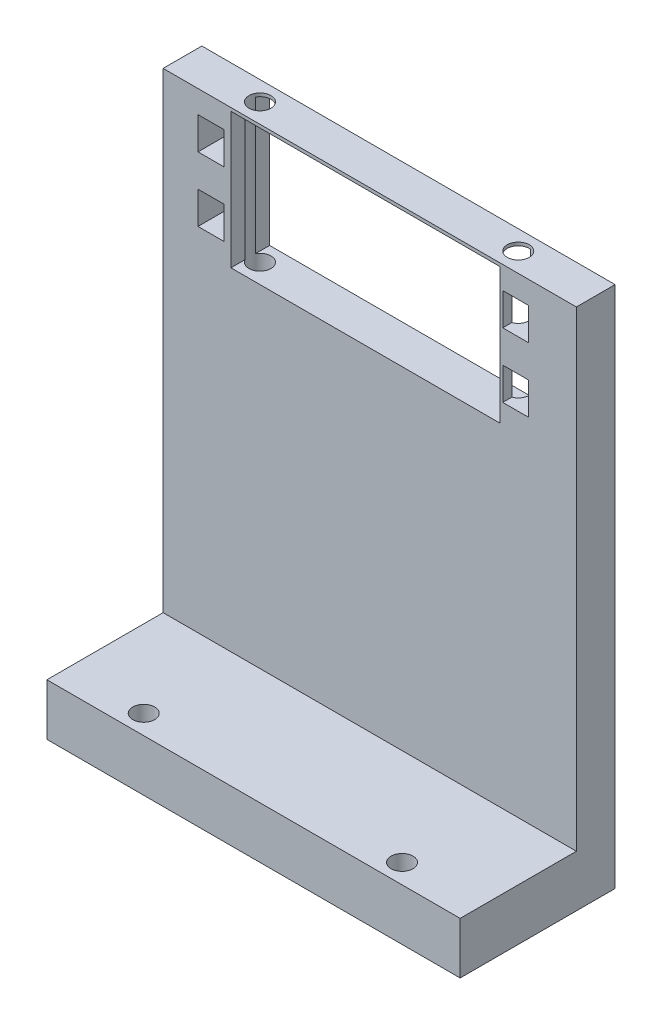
ISO-10303-21;
HEADER;
FILE_DESCRIPTION(('STEP AP214'),'2;1');
FILE_NAME('part.step','',(''),(''),'','','');
FILE_SCHEMA(('AUTOMOTIVE_DESIGN { 1 0 10303 214 1 1 1 1 }'));
ENDSEC;
DATA;
#1=APPLICATION_CONTEXT('core data for automotive mechanical design processes');
#2=APPLICATION_PROTOCOL_DEFINITION('international standard','automotive_design',2000,#1);
#3=PRODUCT_CONTEXT('',#1,'mechanical');
#4=PRODUCT('Part','Part','',(#3));
#5=PRODUCT_RELATED_PRODUCT_CATEGORY('part','',(#4));
#6=PRODUCT_DEFINITION_FORMATION('','',#4);
#7=PRODUCT_DEFINITION_CONTEXT('part definition',#1,'design');
#8=PRODUCT_DEFINITION('design','',#6,#7);
#9=PRODUCT_DEFINITION_SHAPE('','',#8);
#10=(LENGTH_UNIT() NAMED_UNIT(*) SI_UNIT(.MILLI.,.METRE.));
#11=(NAMED_UNIT(*) PLANE_ANGLE_UNIT() SI_UNIT($,.RADIAN.));
#12=(NAMED_UNIT(*) SI_UNIT($,.STERADIAN.) SOLID_ANGLE_UNIT());
#13=UNCERTAINTY_MEASURE_WITH_UNIT(LENGTH_MEASURE(1.E-05),#10,'distance_accuracy_value','');
#14=(GEOMETRIC_REPRESENTATION_CONTEXT(3) GLOBAL_UNCERTAINTY_ASSIGNED_CONTEXT((#13)) GLOBAL_UNIT_ASSIGNED_CONTEXT((#10,
#11,#12)) REPRESENTATION_CONTEXT('',''));
#15=CARTESIAN_POINT('',(0.,0.,0.));
#16=DIRECTION('',(0.,0.,1.));
#17=DIRECTION('',(1.,0.,0.));
#18=AXIS2_PLACEMENT_3D('',#15,#16,#17);
#19=CARTESIAN_POINT('',(-10.5,59.5,-1.2E-05));
#20=DIRECTION('',(-1.,0.,0.));
#21=DIRECTION('',(0.,0.,1.));
#22=AXIS2_PLACEMENT_3D('',#19,#20,#21);
#23=PLANE('',#22);
#24=DIRECTION('',(0.,0.,1.));
#25=VECTOR('',#24,1.);
#26=CARTESIAN_POINT('',(-10.5,59.5,-1.2E-05));
#27=LINE('',#26,#25);
#28=CARTESIAN_POINT('',(-10.5,59.5,3.8));
#29=VERTEX_POINT('',#28);
#30=CARTESIAN_POINT('',(-10.5,59.5,6.));
#31=VERTEX_POINT('',#30);
#32=EDGE_CURVE('E338',#29,#31,#27,.T.);
#33=ORIENTED_EDGE('',*,*,#32,.F.);
#34=DIRECTION('',(0.,1.,0.));
#35=VECTOR('',#34,1.);
#36=CARTESIAN_POINT('',(-10.5,-1.2E-05,3.8));
#37=LINE('',#36,#35);
#38=CARTESIAN_POINT('',(-10.5,80.5,3.8));
#39=VERTEX_POINT('',#38);
#40=EDGE_CURVE('E60',#29,#39,#37,.T.);
#41=ORIENTED_EDGE('',*,*,#40,.T.);
#42=DIRECTION('',(0.,0.,1.));
#43=VECTOR('',#42,1.);
#44=CARTESIAN_POINT('',(-10.5,80.5,-1.2E-05));
#45=LINE('',#44,#43);
#46=CARTESIAN_POINT('',(-10.5,80.5,6.));
#47=VERTEX_POINT('',#46);
#48=EDGE_CURVE('E331',#39,#47,#45,.T.);
#49=ORIENTED_EDGE('',*,*,#48,.T.);
#50=DIRECTION('',(0.,1.,0.));
#51=VECTOR('',#50,1.);
#52=CARTESIAN_POINT('',(-10.5,0.,6.));
#53=LINE('',#52,#51);
#54=EDGE_CURVE('E398',#31,#47,#53,.T.);
#55=ORIENTED_EDGE('',*,*,#54,.F.);
#56=EDGE_LOOP('',(#33,#41,#49,#55));
#57=FACE_BOUND('',#56,.T.);
#58=ADVANCED_FACE('F39',(#57),#23,.F.);
#59=CARTESIAN_POINT('',(31.2,59.5,-1.2E-05));
#60=DIRECTION('',(1.,0.,0.));
#61=DIRECTION('',(0.,0.,-1.));
#62=AXIS2_PLACEMENT_3D('',#59,#60,#61);
#63=PLANE('',#62);
#64=DIRECTION('',(0.,0.,1.));
#65=VECTOR('',#64,1.);
#66=CARTESIAN_POINT('',(31.2,59.5,-1.2E-05));
#67=LINE('',#66,#65);
#68=CARTESIAN_POINT('',(31.2,59.5,0.));
#69=VERTEX_POINT('',#68);
#70=CARTESIAN_POINT('',(31.2,59.5,1.31180569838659));
#71=VERTEX_POINT('',#70);
#72=EDGE_CURVE('E341',#69,#71,#67,.T.);
#73=ORIENTED_EDGE('',*,*,#72,.T.);
#74=DIRECTION('',(0.,1.,0.));
#75=VECTOR('',#74,1.);
#76=CARTESIAN_POINT('',(31.2,-1.2E-05,1.31180569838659));
#77=LINE('',#76,#75);
#78=CARTESIAN_POINT('',(31.2,80.5,1.31180569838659));
#79=VERTEX_POINT('',#78);
#80=EDGE_CURVE('E63',#71,#79,#77,.T.);
#81=ORIENTED_EDGE('',*,*,#80,.T.);
#82=DIRECTION('',(0.,0.,1.));
#83=VECTOR('',#82,1.);
#84=CARTESIAN_POINT('',(31.2,80.5,-1.2E-05));
#85=LINE('',#84,#83);
#86=CARTESIAN_POINT('',(31.2,80.5,0.));
#87=VERTEX_POINT('',#86);
#88=EDGE_CURVE('E340',#87,#79,#85,.T.);
#89=ORIENTED_EDGE('',*,*,#88,.F.);
#90=DIRECTION('',(0.,1.,0.));
#91=VECTOR('',#90,1.);
#92=CARTESIAN_POINT('',(31.2,0.,0.));
#93=LINE('',#92,#91);
#94=EDGE_CURVE('E407',#69,#87,#93,.T.);
#95=ORIENTED_EDGE('',*,*,#94,.F.);
#96=EDGE_LOOP('',(#73,#81,#89,#95));
#97=FACE_BOUND('',#96,.T.);
#98=ADVANCED_FACE('F678',(#97),#63,.F.);
#99=CARTESIAN_POINT('',(31.6,72.5,-1.2E-05));
#100=DIRECTION('',(-1.,0.,0.));
#101=DIRECTION('',(0.,0.,1.));
#102=AXIS2_PLACEMENT_3D('',#99,#100,#101);
#103=PLANE('',#102);
#104=DIRECTION('',(0.,0.,1.));
#105=VECTOR('',#104,1.);
#106=CARTESIAN_POINT('',(31.6,72.5,-1.2E-05));
#107=LINE('',#106,#105);
#108=CARTESIAN_POINT('',(31.6,72.5,4.59059737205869));
#109=VERTEX_POINT('',#108);
#110=CARTESIAN_POINT('',(31.6,72.5,6.));
#111=VERTEX_POINT('',#110);
#112=EDGE_CURVE('E313',#109,#111,#107,.T.);
#113=ORIENTED_EDGE('',*,*,#112,.F.);
#114=DIRECTION('',(0.,1.,0.));
#115=VECTOR('',#114,1.);
#116=CARTESIAN_POINT('',(31.6,-1.2E-05,4.59059737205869));
#117=LINE('',#116,#115);
#118=CARTESIAN_POINT('',(31.6,77.5,4.59059737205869));
#119=VERTEX_POINT('',#118);
#120=EDGE_CURVE('E627',#109,#119,#117,.T.);
#121=ORIENTED_EDGE('',*,*,#120,.T.);
#122=DIRECTION('',(0.,0.,1.));
#123=VECTOR('',#122,1.);
#124=CARTESIAN_POINT('',(31.6,77.5,-1.2E-05));
#125=LINE('',#124,#123);
#126=CARTESIAN_POINT('',(31.6,77.5,6.));
#127=VERTEX_POINT('',#126);
#128=EDGE_CURVE('E308',#119,#127,#125,.T.);
#129=ORIENTED_EDGE('',*,*,#128,.T.);
#130=DIRECTION('',(0.,1.,0.));
#131=VECTOR('',#130,1.);
#132=CARTESIAN_POINT('',(31.6,0.,6.));
#133=LINE('',#132,#131);
#134=EDGE_CURVE('E434',#111,#127,#133,.T.);
#135=ORIENTED_EDGE('',*,*,#134,.F.);
#136=EDGE_LOOP('',(#113,#121,#129,#135));
#137=FACE_BOUND('',#136,.T.);
#138=ADVANCED_FACE('F690',(#137),#103,.F.);
#139=CARTESIAN_POINT('',(31.6,62.5,-1.2E-05));
#140=DIRECTION('',(-1.,0.,0.));
#141=DIRECTION('',(0.,0.,1.));
#142=AXIS2_PLACEMENT_3D('',#139,#140,#141);
#143=PLANE('',#142);
#144=DIRECTION('',(0.,0.,1.));
#145=VECTOR('',#144,1.);
#146=CARTESIAN_POINT('',(31.6,62.5,-1.2E-05));
#147=LINE('',#146,#145);
#148=CARTESIAN_POINT('',(31.6,62.5,4.59059737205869));
#149=VERTEX_POINT('',#148);
#150=CARTESIAN_POINT('',(31.6,62.5,6.));
#151=VERTEX_POINT('',#150);
#152=EDGE_CURVE('E289',#149,#151,#147,.T.);
#153=ORIENTED_EDGE('',*,*,#152,.F.);
#154=DIRECTION('',(0.,1.,0.));
#155=VECTOR('',#154,1.);
#156=CARTESIAN_POINT('',(31.6,-1.2E-05,4.59059737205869));
#157=LINE('',#156,#155);
#158=CARTESIAN_POINT('',(31.6,67.5,4.59059737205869));
#159=VERTEX_POINT('',#158);
#160=EDGE_CURVE('E270',#149,#159,#157,.T.);
#161=ORIENTED_EDGE('',*,*,#160,.T.);
#162=DIRECTION('',(0.,0.,1.));
#163=VECTOR('',#162,1.);
#164=CARTESIAN_POINT('',(31.6,67.5,-1.2E-05));
#165=LINE('',#164,#163);
#166=CARTESIAN_POINT('',(31.6,67.5,6.));
#167=VERTEX_POINT('',#166);
#168=EDGE_CURVE('E482',#159,#167,#165,.T.);
#169=ORIENTED_EDGE('',*,*,#168,.T.);
#170=DIRECTION('',(0.,1.,0.));
#171=VECTOR('',#170,1.);
#172=CARTESIAN_POINT('',(31.6,0.,6.));
#173=LINE('',#172,#171);
#174=EDGE_CURVE('E447',#151,#167,#173,.T.);
#175=ORIENTED_EDGE('',*,*,#174,.F.);
#176=EDGE_LOOP('',(#153,#161,#169,#175));
#177=FACE_BOUND('',#176,.T.);
#178=ADVANCED_FACE('F760',(#177),#143,.F.);
#179=CARTESIAN_POINT('',(0.,0.,0.));
#180=DIRECTION('',(0.,0.,-1.));
#181=DIRECTION('',(-1.,0.,0.));
#182=AXIS2_PLACEMENT_3D('',#179,#180,#181);
#183=PLANE('',#182);
#184=DIRECTION('',(0.,-1.,0.));
#185=VECTOR('',#184,1.);
#186=CARTESIAN_POINT('',(-21.,0.,0.));
#187=LINE('',#186,#185);
#188=CARTESIAN_POINT('',(-21.,81.,0.));
#189=VERTEX_POINT('',#188);
#190=CARTESIAN_POINT('',(-21.,0.,0.));
#191=VERTEX_POINT('',#190);
#192=EDGE_CURVE('E362',#189,#191,#187,.T.);
#193=ORIENTED_EDGE('',*,*,#192,.F.);
#194=DIRECTION('',(-1.,0.,0.));
#195=VECTOR('',#194,1.);
#196=CARTESIAN_POINT('',(-21.,81.,0.));
#197=LINE('',#196,#195);
#198=CARTESIAN_POINT('',(43.,81.,0.));
#199=VERTEX_POINT('',#198);
#200=EDGE_CURVE('E334',#199,#189,#197,.T.);
#201=ORIENTED_EDGE('',*,*,#200,.F.);
#202=DIRECTION('',(0.,1.,0.));
#203=VECTOR('',#202,1.);
#204=CARTESIAN_POINT('',(43.,0.,0.));
#205=LINE('',#204,#203);
#206=CARTESIAN_POINT('',(43.,0.,0.));
#207=VERTEX_POINT('',#206);
#208=EDGE_CURVE('E370',#207,#199,#205,.T.);
#209=ORIENTED_EDGE('',*,*,#208,.F.);
#210=DIRECTION('',(1.,0.,0.));
#211=VECTOR('',#210,1.);
#212=CARTESIAN_POINT('',(-21.,0.,0.));
#213=LINE('',#212,#211);
#214=EDGE_CURVE('E376',#191,#207,#213,.T.);
#215=ORIENTED_EDGE('',*,*,#214,.F.);
#216=EDGE_LOOP('',(#193,#201,#209,#215));
#217=FACE_BOUND('',#216,.T.);
#218=DIRECTION('',(-1.,0.,0.));
#219=VECTOR('',#218,1.);
#220=CARTESIAN_POINT('',(0.,80.5,0.));
#221=LINE('',#220,#219);
#222=CARTESIAN_POINT('',(-10.5,80.5,0.));
#223=VERTEX_POINT('',#222);
#224=EDGE_CURVE('E410',#87,#223,#221,.T.);
#225=ORIENTED_EDGE('',*,*,#224,.T.);
#226=DIRECTION('',(0.,1.,0.));
#227=VECTOR('',#226,1.);
#228=CARTESIAN_POINT('',(-10.5,0.,0.));
#229=LINE('',#228,#227);
#230=CARTESIAN_POINT('',(-10.5,59.5,0.));
#231=VERTEX_POINT('',#230);
#232=EDGE_CURVE('E319',#223,#231,#229,.F.);
#233=ORIENTED_EDGE('',*,*,#232,.T.);
#234=DIRECTION('',(-1.,0.,0.));
#235=VECTOR('',#234,1.);
#236=CARTESIAN_POINT('',(0.,59.5,0.));
#237=LINE('',#236,#235);
#238=EDGE_CURVE('E404',#231,#69,#237,.F.);
#239=ORIENTED_EDGE('',*,*,#238,.T.);
#240=ORIENTED_EDGE('',*,*,#94,.T.);
#241=EDGE_LOOP('',(#225,#233,#239,#240));
#242=FACE_BOUND('',#241,.T.);
#243=DIRECTION('',(-1.,0.,0.));
#244=VECTOR('',#243,1.);
#245=CARTESIAN_POINT('',(0.,67.5,0.));
#246=LINE('',#245,#244);
#247=CARTESIAN_POINT('',(-11.6,67.5,0.));
#248=VERTEX_POINT('',#247);
#249=CARTESIAN_POINT('',(-15.6,67.5,0.));
#250=VERTEX_POINT('',#249);
#251=EDGE_CURVE('E324',#248,#250,#246,.T.);
#252=ORIENTED_EDGE('',*,*,#251,.T.);
#253=DIRECTION('',(0.,1.,0.));
#254=VECTOR('',#253,1.);
#255=CARTESIAN_POINT('',(-15.6,0.,0.));
#256=LINE('',#255,#254);
#257=CARTESIAN_POINT('',(-15.6,62.5,0.));
#258=VERTEX_POINT('',#257);
#259=EDGE_CURVE('E465',#250,#258,#256,.F.);
#260=ORIENTED_EDGE('',*,*,#259,.T.);
#261=DIRECTION('',(-1.,0.,0.));
#262=VECTOR('',#261,1.);
#263=CARTESIAN_POINT('',(0.,62.5,0.));
#264=LINE('',#263,#262);
#265=CARTESIAN_POINT('',(-11.6,62.5,0.));
#266=VERTEX_POINT('',#265);
#267=EDGE_CURVE('E461',#258,#266,#264,.F.);
#268=ORIENTED_EDGE('',*,*,#267,.T.);
#269=DIRECTION('',(0.,1.,0.));
#270=VECTOR('',#269,1.);
#271=CARTESIAN_POINT('',(-11.6,0.,0.));
#272=LINE('',#271,#270);
#273=EDGE_CURVE('E463',#266,#248,#272,.T.);
#274=ORIENTED_EDGE('',*,*,#273,.T.);
#275=EDGE_LOOP('',(#252,#260,#268,#274));
#276=FACE_BOUND('',#275,.T.);
#277=DIRECTION('',(-1.,0.,0.));
#278=VECTOR('',#277,1.);
#279=CARTESIAN_POINT('',(0.,77.5,0.));
#280=LINE('',#279,#278);
#281=CARTESIAN_POINT('',(35.6,77.5,0.));
#282=VERTEX_POINT('',#281);
#283=CARTESIAN_POINT('',(31.6,77.5,0.));
#284=VERTEX_POINT('',#283);
#285=EDGE_CURVE('E309',#282,#284,#280,.T.);
#286=ORIENTED_EDGE('',*,*,#285,.T.);
#287=DIRECTION('',(0.,1.,0.));
#288=VECTOR('',#287,1.);
#289=CARTESIAN_POINT('',(31.6,0.,0.));
#290=LINE('',#289,#288);
#291=CARTESIAN_POINT('',(31.6,72.5,0.));
#292=VERTEX_POINT('',#291);
#293=EDGE_CURVE('E478',#284,#292,#290,.F.);
#294=ORIENTED_EDGE('',*,*,#293,.T.);
#295=DIRECTION('',(-1.,0.,0.));
#296=VECTOR('',#295,1.);
#297=CARTESIAN_POINT('',(0.,72.5,0.));
#298=LINE('',#297,#296);
#299=CARTESIAN_POINT('',(35.6,72.5,0.));
#300=VERTEX_POINT('',#299);
#301=EDGE_CURVE('E471',#292,#300,#298,.F.);
#302=ORIENTED_EDGE('',*,*,#301,.T.);
#303=DIRECTION('',(0.,1.,0.));
#304=VECTOR('',#303,1.);
#305=CARTESIAN_POINT('',(35.6,0.,0.));
#306=LINE('',#305,#304);
#307=EDGE_CURVE('E480',#300,#282,#306,.T.);
#308=ORIENTED_EDGE('',*,*,#307,.T.);
#309=EDGE_LOOP('',(#286,#294,#302,#308));
#310=FACE_BOUND('',#309,.T.);
#311=DIRECTION('',(-1.,0.,0.));
#312=VECTOR('',#311,1.);
#313=CARTESIAN_POINT('',(0.,67.5,0.));
#314=LINE('',#313,#312);
#315=CARTESIAN_POINT('',(35.6,67.5,0.));
#316=VERTEX_POINT('',#315);
#317=CARTESIAN_POINT('',(31.6,67.5,0.));
#318=VERTEX_POINT('',#317);
#319=EDGE_CURVE('E290',#316,#318,#314,.T.);
#320=ORIENTED_EDGE('',*,*,#319,.T.);
#321=DIRECTION('',(0.,1.,0.));
#322=VECTOR('',#321,1.);
#323=CARTESIAN_POINT('',(31.6,0.,0.));
#324=LINE('',#323,#322);
#325=CARTESIAN_POINT('',(31.6,62.5,0.));
#326=VERTEX_POINT('',#325);
#327=EDGE_CURVE('E486',#318,#326,#324,.F.);
#328=ORIENTED_EDGE('',*,*,#327,.T.);
#329=DIRECTION('',(-1.,0.,0.));
#330=VECTOR('',#329,1.);
#331=CARTESIAN_POINT('',(0.,62.5,0.));
#332=LINE('',#331,#330);
#333=CARTESIAN_POINT('',(35.6,62.5,0.));
#334=VERTEX_POINT('',#333);
#335=EDGE_CURVE('E285',#326,#334,#332,.F.);
#336=ORIENTED_EDGE('',*,*,#335,.T.);
#337=DIRECTION('',(0.,1.,0.));
#338=VECTOR('',#337,1.);
#339=CARTESIAN_POINT('',(35.6,0.,0.));
#340=LINE('',#339,#338);
#341=EDGE_CURVE('E292',#334,#316,#340,.T.);
#342=ORIENTED_EDGE('',*,*,#341,.T.);
#343=EDGE_LOOP('',(#320,#328,#336,#342));
#344=FACE_BOUND('',#343,.T.);
#345=DIRECTION('',(-1.,0.,0.));
#346=VECTOR('',#345,1.);
#347=CARTESIAN_POINT('',(0.,77.5,0.));
#348=LINE('',#347,#346);
#349=CARTESIAN_POINT('',(-11.6,77.5,0.));
#350=VERTEX_POINT('',#349);
#351=CARTESIAN_POINT('',(-15.6,77.5,0.));
#352=VERTEX_POINT('',#351);
#353=EDGE_CURVE('E500',#350,#352,#348,.T.);
#354=ORIENTED_EDGE('',*,*,#353,.T.);
#355=DIRECTION('',(0.,1.,0.));
#356=VECTOR('',#355,1.);
#357=CARTESIAN_POINT('',(-15.6,0.,0.));
#358=LINE('',#357,#356);
#359=CARTESIAN_POINT('',(-15.6,72.5,0.));
#360=VERTEX_POINT('',#359);
#361=EDGE_CURVE('E472',#352,#360,#358,.F.);
#362=ORIENTED_EDGE('',*,*,#361,.T.);
#363=DIRECTION('',(-1.,0.,0.));
#364=VECTOR('',#363,1.);
#365=CARTESIAN_POINT('',(0.,72.5,0.));
#366=LINE('',#365,#364);
#367=CARTESIAN_POINT('',(-11.6,72.5,0.));
#368=VERTEX_POINT('',#367);
#369=EDGE_CURVE('E491',#360,#368,#366,.F.);
#370=ORIENTED_EDGE('',*,*,#369,.T.);
#371=DIRECTION('',(0.,1.,0.));
#372=VECTOR('',#371,1.);
#373=CARTESIAN_POINT('',(-11.6,0.,0.));
#374=LINE('',#373,#372);
#375=EDGE_CURVE('E493',#368,#350,#374,.T.);
#376=ORIENTED_EDGE('',*,*,#375,.T.);
#377=EDGE_LOOP('',(#354,#362,#370,#376));
#378=FACE_BOUND('',#377,.T.);
#379=ADVANCED_FACE('F672',(#217,#242,#276,#310,#344,#378),#183,.T.);
#380=CARTESIAN_POINT('',(-21.,8.,24.));
#381=DIRECTION('',(0.,-1.,0.));
#382=DIRECTION('',(0.,0.,-1.));
#383=AXIS2_PLACEMENT_3D('',#380,#381,#382);
#384=PLANE('',#383);
#385=CARTESIAN_POINT('',(-9.,8.,21.));
#386=DIRECTION('',(0.,-1.,0.));
#387=DIRECTION('',(0.,0.,-1.));
#388=AXIS2_PLACEMENT_3D('',#385,#386,#387);
#389=CIRCLE('',#388,1.7);
#390=CARTESIAN_POINT('',(-9.,8.,19.3));
#391=VERTEX_POINT('',#390);
#392=EDGE_CURVE('E507',#391,#391,#389,.T.);
#393=ORIENTED_EDGE('',*,*,#392,.T.);
#394=EDGE_LOOP('',(#393));
#395=FACE_BOUND('',#394,.T.);
#396=CARTESIAN_POINT('',(31.,8.,21.));
#397=DIRECTION('',(0.,-1.,0.));
#398=DIRECTION('',(0.,0.,-1.));
#399=AXIS2_PLACEMENT_3D('',#396,#397,#398);
#400=CIRCLE('',#399,1.7);
#401=CARTESIAN_POINT('',(31.,8.,19.3));
#402=VERTEX_POINT('',#401);
#403=EDGE_CURVE('E504',#402,#402,#400,.T.);
#404=ORIENTED_EDGE('',*,*,#403,.T.);
#405=EDGE_LOOP('',(#404));
#406=FACE_BOUND('',#405,.T.);
#407=DIRECTION('',(1.,0.,0.));
#408=VECTOR('',#407,1.);
#409=CARTESIAN_POINT('',(-21.,8.,6.));
#410=LINE('',#409,#408);
#411=CARTESIAN_POINT('',(-21.,8.,6.));
#412=VERTEX_POINT('',#411);
#413=CARTESIAN_POINT('',(43.,8.,6.));
#414=VERTEX_POINT('',#413);
#415=EDGE_CURVE('E389',#412,#414,#410,.T.);
#416=ORIENTED_EDGE('',*,*,#415,.F.);
#417=DIRECTION('',(0.,0.,-1.));
#418=VECTOR('',#417,1.);
#419=CARTESIAN_POINT('',(-21.,8.,24.));
#420=LINE('',#419,#418);
#421=CARTESIAN_POINT('',(-21.,8.,24.));
#422=VERTEX_POINT('',#421);
#423=EDGE_CURVE('E373',#422,#412,#420,.T.);
#424=ORIENTED_EDGE('',*,*,#423,.F.);
#425=DIRECTION('',(-1.,0.,0.));
#426=VECTOR('',#425,1.);
#427=CARTESIAN_POINT('',(-21.,8.,24.));
#428=LINE('',#427,#426);
#429=CARTESIAN_POINT('',(43.,8.,24.));
#430=VERTEX_POINT('',#429);
#431=EDGE_CURVE('E371',#430,#422,#428,.T.);
#432=ORIENTED_EDGE('',*,*,#431,.F.);
#433=DIRECTION('',(0.,0.,-1.));
#434=VECTOR('',#433,1.);
#435=CARTESIAN_POINT('',(43.,8.,24.));
#436=LINE('',#435,#434);
#437=EDGE_CURVE('E385',#430,#414,#436,.T.);
#438=ORIENTED_EDGE('',*,*,#437,.T.);
#439=EDGE_LOOP('',(#416,#424,#432,#438));
#440=FACE_BOUND('',#439,.T.);
#441=ADVANCED_FACE('F736',(#395,#406,#440),#384,.F.);
#442=CARTESIAN_POINT('',(-21.,0.,24.));
#443=DIRECTION('',(1.,0.,0.));
#444=DIRECTION('',(0.,0.,-1.));
#445=AXIS2_PLACEMENT_3D('',#442,#443,#444);
#446=PLANE('',#445);
#447=ORIENTED_EDGE('',*,*,#423,.T.);
#448=DIRECTION('',(0.,-1.,0.));
#449=VECTOR('',#448,1.);
#450=CARTESIAN_POINT('',(-21.,0.,6.));
#451=LINE('',#450,#449);
#452=CARTESIAN_POINT('',(-21.,81.,6.));
#453=VERTEX_POINT('',#452);
#454=EDGE_CURVE('E350',#453,#412,#451,.T.);
#455=ORIENTED_EDGE('',*,*,#454,.F.);
#456=DIRECTION('',(0.,0.,-1.));
#457=VECTOR('',#456,1.);
#458=CARTESIAN_POINT('',(-21.,81.,6.));
#459=LINE('',#458,#457);
#460=EDGE_CURVE('E353',#453,#189,#459,.T.);
#461=ORIENTED_EDGE('',*,*,#460,.T.);
#462=ORIENTED_EDGE('',*,*,#192,.T.);
#463=DIRECTION('',(0.,0.,-1.));
#464=VECTOR('',#463,1.);
#465=CARTESIAN_POINT('',(-21.,0.,24.));
#466=LINE('',#465,#464);
#467=CARTESIAN_POINT('',(-21.,0.,24.));
#468=VERTEX_POINT('',#467);
#469=EDGE_CURVE('E387',#468,#191,#466,.T.);
#470=ORIENTED_EDGE('',*,*,#469,.F.);
#471=DIRECTION('',(0.,-1.,0.));
#472=VECTOR('',#471,1.);
#473=CARTESIAN_POINT('',(-21.,0.,24.));
#474=LINE('',#473,#472);
#475=EDGE_CURVE('E361',#422,#468,#474,.T.);
#476=ORIENTED_EDGE('',*,*,#475,.F.);
#477=EDGE_LOOP('',(#447,#455,#461,#462,#470,#476));
#478=FACE_BOUND('',#477,.T.);
#479=ADVANCED_FACE('F41',(#478),#446,.F.);
#480=CARTESIAN_POINT('',(-21.,0.,24.));
#481=DIRECTION('',(0.,1.,0.));
#482=DIRECTION('',(0.,0.,1.));
#483=AXIS2_PLACEMENT_3D('',#480,#481,#482);
#484=PLANE('',#483);
#485=CARTESIAN_POINT('',(-9.,0.,22.7));
#486=CARTESIAN_POINT('',(-8.97196460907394,0.,22.700002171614));
#487=CARTESIAN_POINT('',(-8.94392780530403,0.,22.6993318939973));
#488=CARTESIAN_POINT('',(-8.88811734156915,0.,22.6966337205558));
#489=CARTESIAN_POINT('',(-8.86034321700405,0.,22.6946153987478));
#490=CARTESIAN_POINT('',(-8.80505776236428,0.,22.6892216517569));
#491=CARTESIAN_POINT('',(-8.77754581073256,0.,22.6858526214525));
#492=CARTESIAN_POINT('',(-8.72278501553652,0.,22.6777614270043));
#493=CARTESIAN_POINT('',(-8.69553571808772,0.,22.6730423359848));
#494=CARTESIAN_POINT('',(-8.64129995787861,0.,22.6622541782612));
#495=CARTESIAN_POINT('',(-8.61431354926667,0.,22.656184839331));
#496=CARTESIAN_POINT('',(-8.56060297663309,0.,22.6426997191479));
#497=CARTESIAN_POINT('',(-8.53387970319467,0.,22.6352803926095));
#498=CARTESIAN_POINT('',(-8.48069462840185,0.,22.6190980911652));
#499=CARTESIAN_POINT('',(-8.45423485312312,0.,22.6103284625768));
#500=CARTESIAN_POINT('',(-8.40157510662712,0.,22.5914503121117));
#501=CARTESIAN_POINT('',(-8.3753785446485,0.,22.5813322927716));
#502=CARTESIAN_POINT('',(-8.32355048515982,0.,22.5598799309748));
#503=CARTESIAN_POINT('',(-8.29791794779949,0.,22.5485481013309));
#504=CARTESIAN_POINT('',(-8.24741203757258,0.,22.5247236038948));
#505=CARTESIAN_POINT('',(-8.22253466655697,0.,22.5122394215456));
#506=CARTESIAN_POINT('',(-8.17353777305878,0.,22.4861149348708));
#507=CARTESIAN_POINT('',(-8.14941534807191,0.,22.4724800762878));
#508=CARTESIAN_POINT('',(-8.10192730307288,0.,22.4440568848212));
#509=CARTESIAN_POINT('',(-8.07856022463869,0.,22.4292709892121));
#510=CARTESIAN_POINT('',(-8.03258134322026,0.,22.3985488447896));
#511=CARTESIAN_POINT('',(-8.00996984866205,0.,22.3826121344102));
#512=CARTESIAN_POINT('',(-7.96550021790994,0.,22.3495913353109));
#513=CARTESIAN_POINT('',(-7.94364442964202,0.,22.3325040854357));
#514=CARTESIAN_POINT('',(-7.90068447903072,0.,22.2971844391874));
#515=CARTESIAN_POINT('',(-7.87958491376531,0.,22.278946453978));
#516=CARTESIAN_POINT('',(-7.8381337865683,0.,22.2413293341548));
#517=CARTESIAN_POINT('',(-7.81778919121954,0.,22.2219425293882));
#518=CARTESIAN_POINT('',(-7.77810215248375,0.,22.1822748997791));
#519=CARTESIAN_POINT('',(-7.75875711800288,0.,22.1619966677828));
#520=CARTESIAN_POINT('',(-7.72121286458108,0.,22.1206580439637));
#521=CARTESIAN_POINT('',(-7.70300670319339,0.,22.0996039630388));
#522=CARTESIAN_POINT('',(-7.6677369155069,0.,22.0567177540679));
#523=CARTESIAN_POINT('',(-7.65066852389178,0.,22.034889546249));
#524=CARTESIAN_POINT('',(-7.61767236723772,0.,21.990457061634));
#525=CARTESIAN_POINT('',(-7.60174232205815,0.,21.9678544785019));
#526=CARTESIAN_POINT('',(-7.57102023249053,0.,21.9218755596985));
#527=CARTESIAN_POINT('',(-7.55622864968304,0.,21.8984989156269));
#528=CARTESIAN_POINT('',(-7.52778058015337,0.,21.8509738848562));
#529=CARTESIAN_POINT('',(-7.51412747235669,0.,21.8268234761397));
#530=CARTESIAN_POINT('',(-7.48795389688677,0.,21.7777523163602));
#531=CARTESIAN_POINT('',(-7.47543981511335,0.,21.7528281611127));
#532=CARTESIAN_POINT('',(-7.45153941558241,0.,21.7022118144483));
#533=CARTESIAN_POINT('',(-7.44016246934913,0.,21.6765152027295));
#534=CARTESIAN_POINT('',(-7.41867657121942,0.,21.624679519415));
#535=CARTESIAN_POINT('',(-7.40856423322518,0.,21.5985418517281));
#536=CARTESIAN_POINT('',(-7.38969747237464,0.,21.5459823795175));
#537=CARTESIAN_POINT('',(-7.3809342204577,0.,21.5195637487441));
#538=CARTESIAN_POINT('',(-7.36476102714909,0.,21.4664448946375));
#539=CARTESIAN_POINT('',(-7.35734518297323,0.,21.4397464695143));
#540=CARTESIAN_POINT('',(-7.34386428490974,0.,21.3860691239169));
#541=CARTESIAN_POINT('',(-7.33779647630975,0.,21.3590908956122));
#542=CARTESIAN_POINT('',(-7.32700833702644,0.,21.3048550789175));
#543=CARTESIAN_POINT('',(-7.32228855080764,0.,21.277597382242));
#544=CARTESIAN_POINT('',(-7.31419300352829,0.,21.2228033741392));
#545=CARTESIAN_POINT('',(-7.3108211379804,0.,21.1952664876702));
#546=CARTESIAN_POINT('',(-7.30541862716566,0.,21.1399144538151));
#547=CARTESIAN_POINT('',(-7.30339518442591,0.,21.1120986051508));
#548=CARTESIAN_POINT('',(-7.30068413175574,0.,21.0561889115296));
#549=CARTESIAN_POINT('',(-7.30000687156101,0.,21.0280945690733));
#550=CARTESIAN_POINT('',(-7.29999314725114,0.,20.9719823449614));
#551=CARTESIAN_POINT('',(-7.30065301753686,0.,20.943964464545));
#552=CARTESIAN_POINT('',(-7.30333604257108,0.,20.8881858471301));
#553=CARTESIAN_POINT('',(-7.30534982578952,0.,20.8604246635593));
#554=CARTESIAN_POINT('',(-7.31073544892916,0.,20.8051600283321));
#555=CARTESIAN_POINT('',(-7.3141011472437,0.,20.7776559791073));
#556=CARTESIAN_POINT('',(-7.3221878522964,0.,20.7229056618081));
#557=CARTESIAN_POINT('',(-7.32690604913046,0.,20.6956589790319));
#558=CARTESIAN_POINT('',(-7.33769425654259,0.,20.6414231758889));
#559=CARTESIAN_POINT('',(-7.34376481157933,0.,20.6144341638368));
#560=CARTESIAN_POINT('',(-7.3572542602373,0.,20.5607130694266));
#561=CARTESIAN_POINT('',(-7.36467697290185,0.,20.5339819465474));
#562=CARTESIAN_POINT('',(-7.38086801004,0.,20.4807758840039));
#563=CARTESIAN_POINT('',(-7.38964325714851,0.,20.4543030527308));
#564=CARTESIAN_POINT('',(-7.40853428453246,0.,20.401611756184));
#565=CARTESIAN_POINT('',(-7.41865981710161,0.,20.3753967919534));
#566=CARTESIAN_POINT('',(-7.44012035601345,0.,20.3235506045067));
#567=CARTESIAN_POINT('',(-7.45145197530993,0.,20.2979179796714));
#568=CARTESIAN_POINT('',(-7.47527631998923,0.,20.2474120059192));
#569=CARTESIAN_POINT('',(-7.48776055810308,0.,20.2225346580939));
#570=CARTESIAN_POINT('',(-7.51388508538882,0.,20.1735377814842));
#571=CARTESIAN_POINT('',(-7.52751992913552,0.,20.1494153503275));
#572=CARTESIAN_POINT('',(-7.55594310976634,0.,20.1019273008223));
#573=CARTESIAN_POINT('',(-7.57072900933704,0.,20.0785602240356));
#574=CARTESIAN_POINT('',(-7.60145115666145,0.,20.032581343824));
#575=CARTESIAN_POINT('',(-7.6173878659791,0.,20.0099698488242));
#576=CARTESIAN_POINT('',(-7.65040866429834,0.,19.9655002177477));
#577=CARTESIAN_POINT('',(-7.66749591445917,0.,19.9436444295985));
#578=CARTESIAN_POINT('',(-7.70281556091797,0.,19.9006844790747));
#579=CARTESIAN_POINT('',(-7.72105354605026,0.,19.8795849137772));
#580=CARTESIAN_POINT('',(-7.7586706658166,0.,19.8381337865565));
#581=CARTESIAN_POINT('',(-7.7780574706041,0.,19.8177891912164));
#582=CARTESIAN_POINT('',(-7.81772510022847,0.,19.7781021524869));
#583=CARTESIAN_POINT('',(-7.83800333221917,0.,19.7587571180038));
#584=CARTESIAN_POINT('',(-7.87934195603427,0.,19.7212128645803));
#585=CARTESIAN_POINT('',(-7.90039603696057,0.,19.7030067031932));
#586=CARTESIAN_POINT('',(-7.94328224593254,0.,19.6677369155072));
#587=CARTESIAN_POINT('',(-7.96511045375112,0.,19.6506685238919));
#588=CARTESIAN_POINT('',(-8.00954293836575,0.,19.6176723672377));
#589=CARTESIAN_POINT('',(-8.03214552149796,0.,19.6017423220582));
#590=CARTESIAN_POINT('',(-8.07812444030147,0.,19.5710202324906));
#591=CARTESIAN_POINT('',(-8.10150108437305,0.,19.5562286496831));
#592=CARTESIAN_POINT('',(-8.14902611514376,0.,19.5277805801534));
#593=CARTESIAN_POINT('',(-8.17317652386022,0.,19.5141274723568));
#594=CARTESIAN_POINT('',(-8.22224768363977,0.,19.4879538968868));
#595=CARTESIAN_POINT('',(-8.24717183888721,0.,19.4754398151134));
#596=CARTESIAN_POINT('',(-8.29778818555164,0.,19.4515394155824));
#597=CARTESIAN_POINT('',(-8.32348479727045,0.,19.4401624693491));
#598=CARTESIAN_POINT('',(-8.37532048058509,0.,19.4186765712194));
#599=CARTESIAN_POINT('',(-8.40145814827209,0.,19.4085642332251));
#600=CARTESIAN_POINT('',(-8.45401762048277,0.,19.3896974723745));
#601=CARTESIAN_POINT('',(-8.48043625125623,0.,19.3809342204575));
#602=CARTESIAN_POINT('',(-8.53355510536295,0.,19.3647610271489));
#603=CARTESIAN_POINT('',(-8.56025353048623,0.,19.357345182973));
#604=CARTESIAN_POINT('',(-8.61393087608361,0.,19.3438642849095));
#605=CARTESIAN_POINT('',(-8.64090910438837,0.,19.3377964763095));
#606=CARTESIAN_POINT('',(-8.69514492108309,0.,19.3270083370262));
#607=CARTESIAN_POINT('',(-8.72240261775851,0.,19.3222885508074));
#608=CARTESIAN_POINT('',(-8.7771966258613,0.,19.314193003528));
#609=CARTESIAN_POINT('',(-8.8047335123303,0.,19.3108211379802));
#610=CARTESIAN_POINT('',(-8.86008554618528,0.,19.3054186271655));
#611=CARTESIAN_POINT('',(-8.88790139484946,0.,19.3033951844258));
#612=CARTESIAN_POINT('',(-8.94381108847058,0.,19.3006841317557));
#613=CARTESIAN_POINT('',(-8.97190543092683,0.,19.300006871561));
#614=CARTESIAN_POINT('',(-9.02801765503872,0.,19.2999931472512));
#615=CARTESIAN_POINT('',(-9.05603553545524,0.,19.3006530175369));
#616=CARTESIAN_POINT('',(-9.11181415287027,0.,19.3033360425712));
#617=CARTESIAN_POINT('',(-9.13957533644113,0.,19.3053498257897));
#618=CARTESIAN_POINT('',(-9.19483997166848,0.,19.3107354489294));
#619=CARTESIAN_POINT('',(-9.22234402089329,0.,19.3141011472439));
#620=CARTESIAN_POINT('',(-9.27709433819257,0.,19.3221878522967));
#621=CARTESIAN_POINT('',(-9.30434102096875,0.,19.3269060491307));
#622=CARTESIAN_POINT('',(-9.3585768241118,0.,19.3376942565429));
#623=CARTESIAN_POINT('',(-9.38556583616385,0.,19.3437648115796));
#624=CARTESIAN_POINT('',(-9.43928693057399,0.,19.3572542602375));
#625=CARTESIAN_POINT('',(-9.4660180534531,0.,19.3646769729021));
#626=CARTESIAN_POINT('',(-9.5192241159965,0.,19.3808680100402));
#627=CARTESIAN_POINT('',(-9.54569694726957,0.,19.3896432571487));
#628=CARTESIAN_POINT('',(-9.59838824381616,0.,19.4085342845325));
#629=CARTESIAN_POINT('',(-9.62460320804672,0.,19.4186598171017));
#630=CARTESIAN_POINT('',(-9.67644939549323,0.,19.4401203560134));
#631=CARTESIAN_POINT('',(-9.70208202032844,0.,19.4514519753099));
#632=CARTESIAN_POINT('',(-9.75258799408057,0.,19.4752763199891));
#633=CARTESIAN_POINT('',(-9.77746534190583,0.,19.487760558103));
#634=CARTESIAN_POINT('',(-9.82646221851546,0.,19.5138850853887));
#635=CARTESIAN_POINT('',(-9.85058464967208,0.,19.5275199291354));
#636=CARTESIAN_POINT('',(-9.89807269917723,0.,19.5559431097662));
#637=CARTESIAN_POINT('',(-9.92143977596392,0.,19.5707290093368));
#638=CARTESIAN_POINT('',(-9.96741865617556,0.,19.6014511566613));
#639=CARTESIAN_POINT('',(-9.99003015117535,0.,19.6173878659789));
#640=CARTESIAN_POINT('',(-10.0344997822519,0.,19.6504086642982));
#641=CARTESIAN_POINT('',(-10.0563555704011,0.,19.667495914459));
#642=CARTESIAN_POINT('',(-10.099315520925,0.,19.7028155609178));
#643=CARTESIAN_POINT('',(-10.1204150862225,0.,19.7210535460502));
#644=CARTESIAN_POINT('',(-10.1618662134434,0.,19.7586706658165));
#645=CARTESIAN_POINT('',(-10.1822108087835,0.,19.7780574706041));
#646=CARTESIAN_POINT('',(-10.2218978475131,0.,19.8177251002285));
#647=CARTESIAN_POINT('',(-10.2412428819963,0.,19.8380033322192));
#648=CARTESIAN_POINT('',(-10.2787871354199,0.,19.8793419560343));
#649=CARTESIAN_POINT('',(-10.296993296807,0.,19.9003960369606));
#650=CARTESIAN_POINT('',(-10.332263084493,0.,19.9432822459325));
#651=CARTESIAN_POINT('',(-10.3493314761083,0.,19.9651104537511));
#652=CARTESIAN_POINT('',(-10.3823276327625,0.,20.0095429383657));
#653=CARTESIAN_POINT('',(-10.3982576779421,0.,20.032145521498));
#654=CARTESIAN_POINT('',(-10.4289797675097,0.,20.0781244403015));
#655=CARTESIAN_POINT('',(-10.4437713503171,0.,20.1015010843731));
#656=CARTESIAN_POINT('',(-10.4722194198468,0.,20.1490261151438));
#657=CARTESIAN_POINT('',(-10.4858725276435,0.,20.1731765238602));
#658=CARTESIAN_POINT('',(-10.5120461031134,0.,20.2222476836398));
#659=CARTESIAN_POINT('',(-10.5245601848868,0.,20.2471718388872));
#660=CARTESIAN_POINT('',(-10.5484605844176,0.,20.2977881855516));
#661=CARTESIAN_POINT('',(-10.5598375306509,0.,20.3234847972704));
#662=CARTESIAN_POINT('',(-10.5813234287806,0.,20.3753204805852));
#663=CARTESIAN_POINT('',(-10.5914357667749,0.,20.4014581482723));
#664=CARTESIAN_POINT('',(-10.6103025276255,0.,20.4540176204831));
#665=CARTESIAN_POINT('',(-10.6190657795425,0.,20.4804362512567));
#666=CARTESIAN_POINT('',(-10.6352389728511,0.,20.5335551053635));
#667=CARTESIAN_POINT('',(-10.642654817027,0.,20.5602535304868));
#668=CARTESIAN_POINT('',(-10.6561357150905,0.,20.6139308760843));
#669=CARTESIAN_POINT('',(-10.6622035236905,0.,20.640909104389));
#670=CARTESIAN_POINT('',(-10.6729916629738,0.,20.6951449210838));
#671=CARTESIAN_POINT('',(-10.6777114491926,0.,20.7224026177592));
#672=CARTESIAN_POINT('',(-10.685806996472,0.,20.7771966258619));
#673=CARTESIAN_POINT('',(-10.6891788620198,0.,20.8047335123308));
#674=CARTESIAN_POINT('',(-10.6945813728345,0.,20.8600855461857));
#675=CARTESIAN_POINT('',(-10.6966048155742,0.,20.8879013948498));
#676=CARTESIAN_POINT('',(-10.6993158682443,0.,20.9438110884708));
#677=CARTESIAN_POINT('',(-10.699993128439,0.,20.9719054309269));
#678=CARTESIAN_POINT('',(-10.7000068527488,0.,21.0280176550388));
#679=CARTESIAN_POINT('',(-10.6993469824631,0.,21.0560355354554));
#680=CARTESIAN_POINT('',(-10.6966639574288,0.,21.1118141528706));
#681=CARTESIAN_POINT('',(-10.6946501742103,0.,21.1395753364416));
#682=CARTESIAN_POINT('',(-10.6892645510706,0.,21.194839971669));
#683=CARTESIAN_POINT('',(-10.6858988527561,0.,21.2223440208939));
#684=CARTESIAN_POINT('',(-10.6778121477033,0.,21.2770943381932));
#685=CARTESIAN_POINT('',(-10.6730939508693,0.,21.3043410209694));
#686=CARTESIAN_POINT('',(-10.6623057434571,0.,21.3585768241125));
#687=CARTESIAN_POINT('',(-10.6562351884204,0.,21.3855658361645));
#688=CARTESIAN_POINT('',(-10.6427457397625,0.,21.4392869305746));
#689=CARTESIAN_POINT('',(-10.6353230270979,0.,21.4660180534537));
#690=CARTESIAN_POINT('',(-10.6191319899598,0.,21.5192241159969));
#691=CARTESIAN_POINT('',(-10.6103567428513,0.,21.5456969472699));
#692=CARTESIAN_POINT('',(-10.5914657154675,0.,21.5983882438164));
#693=CARTESIAN_POINT('',(-10.5813401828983,0.,21.6246032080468));
#694=CARTESIAN_POINT('',(-10.5598796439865,0.,21.6764493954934));
#695=CARTESIAN_POINT('',(-10.5485480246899,0.,21.7020820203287));
#696=CARTESIAN_POINT('',(-10.5247236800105,0.,21.7525879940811));
#697=CARTESIAN_POINT('',(-10.5122394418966,0.,21.7774653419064));
#698=CARTESIAN_POINT('',(-10.4861149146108,0.,21.8264622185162));
#699=CARTESIAN_POINT('',(-10.4724800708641,0.,21.8505846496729));
#700=CARTESIAN_POINT('',(-10.4440568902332,0.,21.8980726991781));
#701=CARTESIAN_POINT('',(-10.4292709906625,0.,21.9214397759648));
#702=CARTESIAN_POINT('',(-10.3985488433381,0.,21.9674186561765));
#703=CARTESIAN_POINT('',(-10.3826121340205,0.,21.9900301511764));
#704=CARTESIAN_POINT('',(-10.3495913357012,0.,22.0344997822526));
#705=CARTESIAN_POINT('',(-10.3325040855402,0.,22.0563555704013));
#706=CARTESIAN_POINT('',(-10.2971844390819,0.,22.0993155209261));
#707=CARTESIAN_POINT('',(-10.2789464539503,0.,22.1204150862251));
#708=CARTESIAN_POINT('',(-10.2413293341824,0.,22.1618662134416));
#709=CARTESIAN_POINT('',(-10.2219425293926,0.,22.182210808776));
#710=CARTESIAN_POINT('',(-10.1822748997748,0.,22.2218978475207));
#711=CARTESIAN_POINT('',(-10.1619966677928,0.,22.2412428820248));
#712=CARTESIAN_POINT('',(-10.120658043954,0.,22.2787871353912));
#713=CARTESIAN_POINT('',(-10.0996039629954,0.,22.2969932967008));
#714=CARTESIAN_POINT('',(-10.0567177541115,0.,22.332263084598));
#715=CARTESIAN_POINT('',(-10.0348895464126,0.,22.3493314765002));
#716=CARTESIAN_POINT('',(-9.99045706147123,0.,22.3823276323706));
#717=CARTESIAN_POINT('',(-9.96785447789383,0.,22.3982576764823));
#718=CARTESIAN_POINT('',(-9.92187556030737,0.,22.4289797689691));
#719=CARTESIAN_POINT('',(-9.89849891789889,0.,22.4437713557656));
#720=CARTESIAN_POINT('',(-9.85097388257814,0.,22.4722194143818));
#721=CARTESIAN_POINT('',(-9.82682346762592,0.,22.4858725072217));
#722=CARTESIAN_POINT('',(-9.77775232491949,0.,22.5120461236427));
#723=CARTESIAN_POINT('',(-9.75282819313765,0.,22.5245602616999));
#724=CARTESIAN_POINT('',(-9.70221178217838,0.,22.5484605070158));
#725=CARTESIAN_POINT('',(-9.67651508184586,0.,22.5598372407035));
#726=CARTESIAN_POINT('',(-9.62466124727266,0.,22.5813313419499));
#727=CARTESIAN_POINT('',(-9.59850515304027,0.,22.5914512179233));
#728=CARTESIAN_POINT('',(-9.54591408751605,0.,22.610330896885));
#729=CARTESIAN_POINT('',(-9.51948238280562,0.,22.6190997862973));
#730=CARTESIAN_POINT('',(-9.46634251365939,0.,22.6352817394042));
#731=CARTESIAN_POINT('',(-9.43963623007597,0.,22.6427009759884));
#732=CARTESIAN_POINT('',(-9.38594834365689,0.,22.6561862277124));
#733=CARTESIAN_POINT('',(-9.35896750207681,0.,22.6622552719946));
#734=CARTESIAN_POINT('',(-9.30473165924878,0.,22.6730434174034));
#735=CARTESIAN_POINT('',(-9.27747660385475,0.,22.6777622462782));
#736=CARTESIAN_POINT('',(-9.22269302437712,0.,22.6858534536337));
#737=CARTESIAN_POINT('',(-9.19516396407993,0.,22.6892221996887));
#738=CARTESIAN_POINT('',(-9.13983301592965,0.,22.6946159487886));
#739=CARTESIAN_POINT('',(-9.11203045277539,0.,22.6966339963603));
#740=CARTESIAN_POINT('',(-9.05615175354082,0.,22.6993321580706));
#741=CARTESIAN_POINT('',(-9.02807512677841,0.,22.7000021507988));
#742=CARTESIAN_POINT('',(-9.,0.,22.7));
#743=B_SPLINE_CURVE_WITH_KNOTS('',3,(#485,#486,#487,#488,#489,#490,#491,#492,#493,#494,#495,
#496,#497,#498,#499,#500,#501,#502,#503,#504,#505,#506,#507,#508,#509,#510,#511,#512,#513,#514,
#515,#516,#517,#518,#519,#520,#521,#522,#523,#524,#525,#526,#527,#528,#529,#530,#531,#532,#533,
#534,#535,#536,#537,#538,#539,#540,#541,#542,#543,#544,#545,#546,#547,#548,#549,#550,#551,#552,
#553,#554,#555,#556,#557,#558,#559,#560,#561,#562,#563,#564,#565,#566,#567,#568,#569,#570,#571,
#572,#573,#574,#575,#576,#577,#578,#579,#580,#581,#582,#583,#584,#585,#586,#587,#588,#589,#590,
#591,#592,#593,#594,#595,#596,#597,#598,#599,#600,#601,#602,#603,#604,#605,#606,#607,#608,#609,
#610,#611,#612,#613,#614,#615,#616,#617,#618,#619,#620,#621,#622,#623,#624,#625,#626,#627,#628,
#629,#630,#631,#632,#633,#634,#635,#636,#637,#638,#639,#640,#641,#642,#643,#644,#645,#646,#647,
#648,#649,#650,#651,#652,#653,#654,#655,#656,#657,#658,#659,#660,#661,#662,#663,#664,#665,#666,
#667,#668,#669,#670,#671,#672,#673,#674,#675,#676,#677,#678,#679,#680,#681,#682,#683,#684,#685,
#686,#687,#688,#689,#690,#691,#692,#693,#694,#695,#696,#697,#698,#699,#700,#701,#702,#703,#704,
#705,#706,#707,#708,#709,#710,#711,#712,#713,#714,#715,#716,#717,#718,#719,#720,#721,#722,#723,
#724,#725,#726,#727,#728,#729,#730,#731,#732,#733,#734,#735,#736,#737,#738,#739,#740,#741,#742),
.UNSPECIFIED.,.F.,.F.,(4,2,2,2,2,2,2,2,2,2,2,2,2,2,2,2,2,2,2,2,2,2,2,2,2,2,2,2,2,2,2,2,2,2,2,2,
2,2,2,2,2,2,2,2,2,2,2,2,2,2,2,2,2,2,2,2,2,2,2,2,2,2,2,2,2,2,2,2,2,2,2,2,2,2,2,2,2,2,2,2,2,2,2,2,
2,2,2,2,2,2,2,2,2,2,2,2,2,2,2,2,2,2,2,2,2,2,2,2,2,2,2,2,2,2,2,2,2,2,2,2,2,2,2,2,2,2,2,2,4),(0.,
0.0841001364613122,0.167609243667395,0.250727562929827,0.333658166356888,0.416605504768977,
0.499773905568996,0.583366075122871,0.667581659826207,0.751626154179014,0.835094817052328,
0.918188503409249,1.00111079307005,1.08406652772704,1.16726030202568,1.25089496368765,
1.33517017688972,1.41921467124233,1.5026833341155,1.58577702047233,1.66869931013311,
1.75165504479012,1.83484881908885,1.91848348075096,2.00275869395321,2.08680318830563,
2.17027185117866,2.2533655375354,2.33628782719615,2.41924356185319,2.50243733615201,
2.58607199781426,2.67034721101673,2.75439170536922,2.83786036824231,2.92095405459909,
3.00387634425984,3.08683207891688,3.17002585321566,3.25366051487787,3.33793572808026,
3.42198022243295,3.50544888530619,3.58854257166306,3.67146486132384,3.75442059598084,
3.83761437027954,3.9212490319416,4.00552424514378,4.08956873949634,4.17303740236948,
4.2561310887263,4.33905337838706,4.42200911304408,4.50520288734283,4.58883754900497,
4.67311276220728,4.75715725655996,4.84062591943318,4.92371960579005,5.00664189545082,
5.08959763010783,5.17279140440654,5.25642606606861,5.34070127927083,5.42474577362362,
5.50821443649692,5.59130812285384,5.67423041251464,5.75718614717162,5.84037992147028,
5.92401458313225,6.00828979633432,6.09233429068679,6.17580295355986,6.25889663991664,
6.34181892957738,6.42477466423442,6.50796843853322,6.59160310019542,6.67587831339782,
6.75992280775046,6.84339147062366,6.9264851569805,7.00940744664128,7.09236318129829,
7.17555695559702,7.25919161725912,7.34346683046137,7.42751132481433,7.51097998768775,
7.59407367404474,7.67699596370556,7.75995169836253,7.84314547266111,7.92678013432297,
8.01105534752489,8.09509984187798,8.1785685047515,8.26166219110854,8.34458448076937,
8.42754021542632,8.51073398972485,8.59436865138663,8.67864386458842,8.76268835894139,
8.84615702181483,8.92925070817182,9.01217299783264,9.0951287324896,9.17832250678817,
9.26195716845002,9.34623238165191,9.43027687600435,9.51374553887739,9.59683922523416,
9.67976151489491,9.76271724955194,9.84591102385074,9.92954568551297,10.0138208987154,
10.097925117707,10.1814363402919,10.2645554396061,10.3474861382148,10.4304335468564,
10.5136026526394,10.5971968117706,10.6814163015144),.UNSPECIFIED.);
#744=CARTESIAN_POINT('',(-9.,0.,22.7));
#745=VERTEX_POINT('',#744);
#746=EDGE_CURVE('E547',#745,#745,#743,.T.);
#747=ORIENTED_EDGE('',*,*,#746,.T.);
#748=EDGE_LOOP('',(#747));
#749=FACE_BOUND('',#748,.T.);
#750=CARTESIAN_POINT('',(31.,0.,4.7));
#751=CARTESIAN_POINT('',(31.0280353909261,0.,4.70000217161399));
#752=CARTESIAN_POINT('',(31.056072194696,0.,4.69933189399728));
#753=CARTESIAN_POINT('',(31.111882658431,0.,4.69663372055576));
#754=CARTESIAN_POINT('',(31.1396567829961,0.,4.69461539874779));
#755=CARTESIAN_POINT('',(31.1949422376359,0.,4.68922165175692));
#756=CARTESIAN_POINT('',(31.2224541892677,0.,4.68585262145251));
#757=CARTESIAN_POINT('',(31.2772149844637,0.,4.67776142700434));
#758=CARTESIAN_POINT('',(31.3044642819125,0.,4.67304233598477));
#759=CARTESIAN_POINT('',(31.3587000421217,0.,4.66225417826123));
#760=CARTESIAN_POINT('',(31.3856864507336,0.,4.65618483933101));
#761=CARTESIAN_POINT('',(31.4393970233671,0.,4.64269971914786));
#762=CARTESIAN_POINT('',(31.4661202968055,0.,4.63528039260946));
#763=CARTESIAN_POINT('',(31.5193053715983,0.,4.6190980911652));
#764=CARTESIAN_POINT('',(31.545765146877,0.,4.61032846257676));
#765=CARTESIAN_POINT('',(31.598424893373,0.,4.5914503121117));
#766=CARTESIAN_POINT('',(31.6246214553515,0.,4.58133229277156));
#767=CARTESIAN_POINT('',(31.6764495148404,0.,4.55987993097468));
#768=CARTESIAN_POINT('',(31.702082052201,0.,4.54854810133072));
#769=CARTESIAN_POINT('',(31.7525879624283,0.,4.5247236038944));
#770=CARTESIAN_POINT('',(31.7774653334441,0.,4.5122394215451));
#771=CARTESIAN_POINT('',(31.8264622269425,0.,4.48611493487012));
#772=CARTESIAN_POINT('',(31.8505846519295,0.,4.47248007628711));
#773=CARTESIAN_POINT('',(31.8980726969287,0.,4.4440568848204));
#774=CARTESIAN_POINT('',(31.9214397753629,0.,4.42927098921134));
#775=CARTESIAN_POINT('',(31.9674186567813,0.,4.39854884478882));
#776=CARTESIAN_POINT('',(31.9900301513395,0.,4.38261213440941));
#777=CARTESIAN_POINT('',(32.0344997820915,0.,4.34959133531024));
#778=CARTESIAN_POINT('',(32.0563555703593,0.,4.33250408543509));
#779=CARTESIAN_POINT('',(32.0993155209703,0.,4.29718443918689));
#780=CARTESIAN_POINT('',(32.1204150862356,0.,4.27894645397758));
#781=CARTESIAN_POINT('',(32.1618662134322,0.,4.24132933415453));
#782=CARTESIAN_POINT('',(32.1822108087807,0.,4.22194252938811));
#783=CARTESIAN_POINT('',(32.2218978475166,0.,4.18227489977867));
#784=CARTESIAN_POINT('',(32.2412428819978,0.,4.16199666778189));
#785=CARTESIAN_POINT('',(32.2787871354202,0.,4.12065804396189));
#786=CARTESIAN_POINT('',(32.2969932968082,0.,4.09960396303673));
#787=CARTESIAN_POINT('',(32.3322630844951,0.,4.05671775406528));
#788=CARTESIAN_POINT('',(32.3493314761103,0.,4.03488954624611));
#789=CARTESIAN_POINT('',(32.3823276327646,0.,3.9904570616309));
#790=CARTESIAN_POINT('',(32.3982576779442,0.,3.96785447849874));
#791=CARTESIAN_POINT('',(32.4289797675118,0.,3.9218755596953));
#792=CARTESIAN_POINT('',(32.4437713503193,0.,3.89849891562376));
#793=CARTESIAN_POINT('',(32.4722194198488,0.,3.85097388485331));
#794=CARTESIAN_POINT('',(32.4858725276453,0.,3.82682347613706));
#795=CARTESIAN_POINT('',(32.5120461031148,0.,3.77775231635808));
#796=CARTESIAN_POINT('',(32.524560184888,0.,3.75282816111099));
#797=CARTESIAN_POINT('',(32.5484605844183,0.,3.70221181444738));
#798=CARTESIAN_POINT('',(32.5598375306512,0.,3.67651520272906));
#799=CARTESIAN_POINT('',(32.5813234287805,0.,3.62467951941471));
#800=CARTESIAN_POINT('',(32.5914357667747,0.,3.59854185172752));
#801=CARTESIAN_POINT('',(32.6103025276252,0.,3.5459823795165));
#802=CARTESIAN_POINT('',(32.6190657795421,0.,3.51956374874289));
#803=CARTESIAN_POINT('',(32.6352389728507,0.,3.46644489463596));
#804=CARTESIAN_POINT('',(32.6426548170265,0.,3.43974646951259));
#805=CARTESIAN_POINT('',(32.65613571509,0.,3.3860691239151));
#806=CARTESIAN_POINT('',(32.66220352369,0.,3.35909089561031));
#807=CARTESIAN_POINT('',(32.6729916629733,0.,3.30485507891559));
#808=CARTESIAN_POINT('',(32.6777114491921,0.,3.2775973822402));
#809=CARTESIAN_POINT('',(32.6858069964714,0.,3.22280337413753));
#810=CARTESIAN_POINT('',(32.6891788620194,0.,3.19526648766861));
#811=CARTESIAN_POINT('',(32.6945813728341,0.,3.13991445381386));
#812=CARTESIAN_POINT('',(32.6966048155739,0.,3.11209860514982));
#813=CARTESIAN_POINT('',(32.6993158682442,0.,3.05618891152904));
#814=CARTESIAN_POINT('',(32.6999931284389,0.,3.02809456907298));
#815=CARTESIAN_POINT('',(32.7000068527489,0.,2.9719823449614));
#816=CARTESIAN_POINT('',(32.6993469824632,0.,2.94396446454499));
#817=CARTESIAN_POINT('',(32.6966639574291,0.,2.88818584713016));
#818=CARTESIAN_POINT('',(32.6946501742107,0.,2.86042466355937));
#819=CARTESIAN_POINT('',(32.6892645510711,0.,2.80516002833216));
#820=CARTESIAN_POINT('',(32.6858988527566,0.,2.77765597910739));
#821=CARTESIAN_POINT('',(32.6778121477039,0.,2.72290566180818));
#822=CARTESIAN_POINT('',(32.6730939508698,0.,2.69565897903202));
#823=CARTESIAN_POINT('',(32.6623057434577,0.,2.64142317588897));
#824=CARTESIAN_POINT('',(32.6562351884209,0.,2.6144341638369));
#825=CARTESIAN_POINT('',(32.6427457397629,0.,2.5607130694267));
#826=CARTESIAN_POINT('',(32.6353230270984,0.,2.53398194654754));
#827=CARTESIAN_POINT('',(32.6191319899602,0.,2.48077588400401));
#828=CARTESIAN_POINT('',(32.6103567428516,0.,2.45430305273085));
#829=CARTESIAN_POINT('',(32.5914657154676,0.,2.40161175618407));
#830=CARTESIAN_POINT('',(32.5813401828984,0.,2.37539679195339));
#831=CARTESIAN_POINT('',(32.5598796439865,0.,2.32355060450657));
#832=CARTESIAN_POINT('',(32.5485480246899,0.,2.29791797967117));
#833=CARTESIAN_POINT('',(32.5247236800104,0.,2.2474120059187));
#834=CARTESIAN_POINT('',(32.5122394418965,0.,2.2225346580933));
#835=CARTESIAN_POINT('',(32.4861149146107,0.,2.17353778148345));
#836=CARTESIAN_POINT('',(32.472480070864,0.,2.14941535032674));
#837=CARTESIAN_POINT('',(32.4440568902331,0.,2.10192730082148));
#838=CARTESIAN_POINT('',(32.4292709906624,0.,2.07856022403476));
#839=CARTESIAN_POINT('',(32.398548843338,0.,2.03258134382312));
#840=CARTESIAN_POINT('',(32.3826121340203,0.,2.00996984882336));
#841=CARTESIAN_POINT('',(32.3495913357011,0.,1.96550021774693));
#842=CARTESIAN_POINT('',(32.3325040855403,0.,1.94364442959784));
#843=CARTESIAN_POINT('',(32.2971844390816,0.,1.90068447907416));
#844=CARTESIAN_POINT('',(32.2789464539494,0.,1.87958491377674));
#845=CARTESIAN_POINT('',(32.2413293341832,0.,1.83813378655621));
#846=CARTESIAN_POINT('',(32.2219425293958,0.,1.81778919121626));
#847=CARTESIAN_POINT('',(32.1822748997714,0.,1.77810215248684));
#848=CARTESIAN_POINT('',(32.1619966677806,0.,1.75875711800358));
#849=CARTESIAN_POINT('',(32.1206580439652,0.,1.72121286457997));
#850=CARTESIAN_POINT('',(32.0996039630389,0.,1.70300670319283));
#851=CARTESIAN_POINT('',(32.0567177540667,0.,1.66773691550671));
#852=CARTESIAN_POINT('',(32.0348895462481,0.,1.65066852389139));
#853=CARTESIAN_POINT('',(31.9904570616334,0.,1.61767236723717));
#854=CARTESIAN_POINT('',(31.9678544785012,0.,1.60174232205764));
#855=CARTESIAN_POINT('',(31.9218755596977,0.,1.57102023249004));
#856=CARTESIAN_POINT('',(31.8984989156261,0.,1.55622864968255));
#857=CARTESIAN_POINT('',(31.8509738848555,0.,1.52778058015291));
#858=CARTESIAN_POINT('',(31.8268234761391,0.,1.51412747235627));
#859=CARTESIAN_POINT('',(31.7777523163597,0.,1.48795389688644));
#860=CARTESIAN_POINT('',(31.7528281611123,0.,1.47543981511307));
#861=CARTESIAN_POINT('',(31.7022118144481,0.,1.45153941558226));
#862=CARTESIAN_POINT('',(31.6765152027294,0.,1.44016246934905));
#863=CARTESIAN_POINT('',(31.6246795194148,0.,1.41867657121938));
#864=CARTESIAN_POINT('',(31.5985418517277,0.,1.4085642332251));
#865=CARTESIAN_POINT('',(31.5459823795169,0.,1.38969747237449));
#866=CARTESIAN_POINT('',(31.5195637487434,0.,1.38093422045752));
#867=CARTESIAN_POINT('',(31.4664448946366,0.,1.36476102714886));
#868=CARTESIAN_POINT('',(31.4397464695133,0.,1.35734518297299));
#869=CARTESIAN_POINT('',(31.3860691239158,0.,1.34386428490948));
#870=CARTESIAN_POINT('',(31.3590908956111,0.,1.33779647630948));
#871=CARTESIAN_POINT('',(31.3048550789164,0.,1.32700833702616));
#872=CARTESIAN_POINT('',(31.2775973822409,0.,1.32228855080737));
#873=CARTESIAN_POINT('',(31.2228033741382,0.,1.31419300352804));
#874=CARTESIAN_POINT('',(31.1952664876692,0.,1.31082113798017));
#875=CARTESIAN_POINT('',(31.1399144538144,0.,1.30541862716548));
#876=CARTESIAN_POINT('',(31.1120986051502,0.,1.30339518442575));
#877=CARTESIAN_POINT('',(31.0561889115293,0.,1.30068413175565));
#878=CARTESIAN_POINT('',(31.0280945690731,0.,1.30000687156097));
#879=CARTESIAN_POINT('',(30.9719823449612,0.,1.29999314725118));
#880=CARTESIAN_POINT('',(30.9439644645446,0.,1.30065301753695));
#881=CARTESIAN_POINT('',(30.8881858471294,0.,1.30333604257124));
#882=CARTESIAN_POINT('',(30.8604246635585,0.,1.3053498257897));
#883=CARTESIAN_POINT('',(30.8051600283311,0.,1.31073544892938));
#884=CARTESIAN_POINT('',(30.7776559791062,0.,1.31410114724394));
#885=CARTESIAN_POINT('',(30.7229056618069,0.,1.32218785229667));
#886=CARTESIAN_POINT('',(30.6956589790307,0.,1.32690604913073));
#887=CARTESIAN_POINT('',(30.6414231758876,0.,1.33769425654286));
#888=CARTESIAN_POINT('',(30.6144341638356,0.,1.34376481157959));
#889=CARTESIAN_POINT('',(30.5607130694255,0.,1.35725426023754));
#890=CARTESIAN_POINT('',(30.5339819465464,0.,1.36467697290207));
#891=CARTESIAN_POINT('',(30.4807758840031,0.,1.38086801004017));
#892=CARTESIAN_POINT('',(30.4543030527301,0.,1.38964325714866));
#893=CARTESIAN_POINT('',(30.4016117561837,0.,1.40853428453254));
#894=CARTESIAN_POINT('',(30.3753967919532,0.,1.41865981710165));
#895=CARTESIAN_POINT('',(30.323550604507,0.,1.44012035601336));
#896=CARTESIAN_POINT('',(30.297917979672,0.,1.45145197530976));
#897=CARTESIAN_POINT('',(30.2474120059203,0.,1.47527631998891));
#898=CARTESIAN_POINT('',(30.2225346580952,0.,1.48776055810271));
#899=CARTESIAN_POINT('',(30.1735377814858,0.,1.51388508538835));
#900=CARTESIAN_POINT('',(30.1494153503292,0.,1.52751992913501));
#901=CARTESIAN_POINT('',(30.1019273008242,0.,1.55594310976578));
#902=CARTESIAN_POINT('',(30.0785602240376,0.,1.57072900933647));
#903=CARTESIAN_POINT('',(30.0325813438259,0.,1.60145115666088));
#904=CARTESIAN_POINT('',(30.0099698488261,0.,1.61738786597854));
#905=CARTESIAN_POINT('',(29.9655002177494,0.,1.65040866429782));
#906=CARTESIAN_POINT('',(29.9436444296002,0.,1.6674959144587));
#907=CARTESIAN_POINT('',(29.900684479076,0.,1.7028155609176));
#908=CARTESIAN_POINT('',(29.8795849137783,0.,1.72105354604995));
#909=CARTESIAN_POINT('',(29.8381337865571,0.,1.75867066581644));
#910=CARTESIAN_POINT('',(29.8177891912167,0.,1.778057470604));
#911=CARTESIAN_POINT('',(29.7781021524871,0.,1.81772510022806));
#912=CARTESIAN_POINT('',(29.7587571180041,0.,1.83800333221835));
#913=CARTESIAN_POINT('',(29.721212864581,0.,1.87934195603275));
#914=CARTESIAN_POINT('',(29.7030067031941,0.,1.90039603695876));
#915=CARTESIAN_POINT('',(29.6677369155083,0.,1.94328224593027));
#916=CARTESIAN_POINT('',(29.6506685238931,0.,1.96511045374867));
#917=CARTESIAN_POINT('',(29.6176723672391,0.,2.00954293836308));
#918=CARTESIAN_POINT('',(29.6017423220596,0.,2.03214552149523));
#919=CARTESIAN_POINT('',(29.571020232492,0.,2.07812444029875));
#920=CARTESIAN_POINT('',(29.5562286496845,0.,2.10150108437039));
#921=CARTESIAN_POINT('',(29.5277805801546,0.,2.14902611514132));
#922=CARTESIAN_POINT('',(29.5141274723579,0.,2.17317652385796));
#923=CARTESIAN_POINT('',(29.4879538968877,0.,2.22224768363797));
#924=CARTESIAN_POINT('',(29.4754398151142,0.,2.24717183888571));
#925=CARTESIAN_POINT('',(29.4515394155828,0.,2.29778818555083));
#926=CARTESIAN_POINT('',(29.4401624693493,0.,2.32348479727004));
#927=CARTESIAN_POINT('',(29.4186765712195,0.,2.37532048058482));
#928=CARTESIAN_POINT('',(29.4085642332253,0.,2.40145814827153));
#929=CARTESIAN_POINT('',(29.3896974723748,0.,2.45401762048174));
#930=CARTESIAN_POINT('',(29.3809342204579,0.,2.480436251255));
#931=CARTESIAN_POINT('',(29.3647610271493,0.,2.5335551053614));
#932=CARTESIAN_POINT('',(29.3573451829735,0.,2.56025353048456));
#933=CARTESIAN_POINT('',(29.34386428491,0.,2.61393087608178));
#934=CARTESIAN_POINT('',(29.33779647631,0.,2.64090910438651));
#935=CARTESIAN_POINT('',(29.3270083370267,0.,2.69514492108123));
#936=CARTESIAN_POINT('',(29.3222885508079,0.,2.72240261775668));
#937=CARTESIAN_POINT('',(29.3141930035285,0.,2.77719662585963));
#938=CARTESIAN_POINT('',(29.3108211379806,0.,2.80473351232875));
#939=CARTESIAN_POINT('',(29.3054186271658,0.,2.86008554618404));
#940=CARTESIAN_POINT('',(29.3033951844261,0.,2.88790139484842));
#941=CARTESIAN_POINT('',(29.3006841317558,0.,2.94381108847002));
#942=CARTESIAN_POINT('',(29.300006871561,0.,2.97190543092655));
#943=CARTESIAN_POINT('',(29.2999931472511,0.,3.02801765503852));
#944=CARTESIAN_POINT('',(29.3006530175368,0.,3.05603553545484));
#945=CARTESIAN_POINT('',(29.3033360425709,0.,3.11181415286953));
#946=CARTESIAN_POINT('',(29.3053498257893,0.,3.13957533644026));
#947=CARTESIAN_POINT('',(29.3107354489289,0.,3.19483997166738));
#948=CARTESIAN_POINT('',(29.3141011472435,0.,3.22234402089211));
#949=CARTESIAN_POINT('',(29.3221878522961,0.,3.27709433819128));
#950=CARTESIAN_POINT('',(29.3269060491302,0.,3.30434102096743));
#951=CARTESIAN_POINT('',(29.3376942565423,0.,3.35857682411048));
#952=CARTESIAN_POINT('',(29.3437648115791,0.,3.38556583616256));
#953=CARTESIAN_POINT('',(29.357254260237,0.,3.43928693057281));
#954=CARTESIAN_POINT('',(29.3646769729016,0.,3.46601805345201));
#955=CARTESIAN_POINT('',(29.3808680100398,0.,3.51922411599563));
#956=CARTESIAN_POINT('',(29.3896432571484,0.,3.54569694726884));
#957=CARTESIAN_POINT('',(29.4085342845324,0.,3.59838824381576));
#958=CARTESIAN_POINT('',(29.4186598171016,0.,3.62460320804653));
#959=CARTESIAN_POINT('',(29.4401203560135,0.,3.67644939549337));
#960=CARTESIAN_POINT('',(29.45145197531,0.,3.70208202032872));
#961=CARTESIAN_POINT('',(29.4752763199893,0.,3.75258799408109));
#962=CARTESIAN_POINT('',(29.4877605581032,0.,3.77746534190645));
#963=CARTESIAN_POINT('',(29.513885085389,0.,3.82646221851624));
#964=CARTESIAN_POINT('',(29.5275199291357,0.,3.85058464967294));
#965=CARTESIAN_POINT('',(29.5559431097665,0.,3.89807269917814));
#966=CARTESIAN_POINT('',(29.5707290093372,0.,3.92143977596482));
#967=CARTESIAN_POINT('',(29.6014511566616,0.,3.96741865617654));
#968=CARTESIAN_POINT('',(29.6173878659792,0.,3.99003015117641));
#969=CARTESIAN_POINT('',(29.6504086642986,0.,4.03449978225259));
#970=CARTESIAN_POINT('',(29.6674959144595,0.,4.0563555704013));
#971=CARTESIAN_POINT('',(29.7028155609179,0.,4.09931552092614));
#972=CARTESIAN_POINT('',(29.7210535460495,0.,4.12041508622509));
#973=CARTESIAN_POINT('',(29.7586706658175,0.,4.16186621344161));
#974=CARTESIAN_POINT('',(29.7780574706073,0.,4.18221080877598));
#975=CARTESIAN_POINT('',(29.8177251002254,0.,4.22189784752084));
#976=CARTESIAN_POINT('',(29.8380033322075,0.,4.24124288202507));
#977=CARTESIAN_POINT('',(29.8793419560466,0.,4.27878713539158));
#978=CARTESIAN_POINT('',(29.9003960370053,0.,4.29699329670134));
#979=CARTESIAN_POINT('',(29.9432822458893,0.,4.33226308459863));
#980=CARTESIAN_POINT('',(29.9651104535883,0.,4.34933147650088));
#981=CARTESIAN_POINT('',(30.0095429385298,0.,4.38232763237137));
#982=CARTESIAN_POINT('',(30.0321455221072,0.,4.39825767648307));
#983=CARTESIAN_POINT('',(30.0781244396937,0.,4.42897976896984));
#984=CARTESIAN_POINT('',(30.1015010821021,0.,4.44377135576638));
#985=CARTESIAN_POINT('',(30.1490261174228,0.,4.47221941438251));
#986=CARTESIAN_POINT('',(30.1731765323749,0.,4.48587250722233));
#987=CARTESIAN_POINT('',(30.2222476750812,0.,4.51204612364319));
#988=CARTESIAN_POINT('',(30.2471718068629,0.,4.52456026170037));
#989=CARTESIAN_POINT('',(30.2977882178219,0.,4.54846050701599));
#990=CARTESIAN_POINT('',(30.3234849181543,0.,4.55983724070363));
#991=CARTESIAN_POINT('',(30.3753387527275,0.,4.58133134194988));
#992=CARTESIAN_POINT('',(30.40149484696,0.,4.59145121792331));
#993=CARTESIAN_POINT('',(30.4540859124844,0.,4.61033089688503));
#994=CARTESIAN_POINT('',(30.4805176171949,0.,4.61909978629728));
#995=CARTESIAN_POINT('',(30.5336574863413,0.,4.63528173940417));
#996=CARTESIAN_POINT('',(30.5603637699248,0.,4.64270097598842));
#997=CARTESIAN_POINT('',(30.6140516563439,0.,4.6561862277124));
#998=CARTESIAN_POINT('',(30.641032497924,0.,4.66225527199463));
#999=CARTESIAN_POINT('',(30.695268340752,0.,4.67304341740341));
#1000=CARTESIAN_POINT('',(30.7225233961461,0.,4.67776224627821));
#1001=CARTESIAN_POINT('',(30.7773069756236,0.,4.68585345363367));
#1002=CARTESIAN_POINT('',(30.8048360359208,0.,4.68922219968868));
#1003=CARTESIAN_POINT('',(30.8601669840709,0.,4.69461594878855));
#1004=CARTESIAN_POINT('',(30.8879695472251,0.,4.69663399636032));
#1005=CARTESIAN_POINT('',(30.9438482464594,0.,4.69933215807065));
#1006=CARTESIAN_POINT('',(30.9719248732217,0.,4.70000215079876));
#1007=CARTESIAN_POINT('',(31.,0.,4.7));
#1008=B_SPLINE_CURVE_WITH_KNOTS('',3,(#750,#751,#752,#753,#754,#755,#756,#757,#758,#759,#760,
#761,#762,#763,#764,#765,#766,#767,#768,#769,#770,#771,#772,#773,#774,#775,#776,#777,#778,#779,
#780,#781,#782,#783,#784,#785,#786,#787,#788,#789,#790,#791,#792,#793,#794,#795,#796,#797,#798,
#799,#800,#801,#802,#803,#804,#805,#806,#807,#808,#809,#810,#811,#812,#813,#814,#815,#816,#817,
#818,#819,#820,#821,#822,#823,#824,#825,#826,#827,#828,#829,#830,#831,#832,#833,#834,#835,#836,
#837,#838,#839,#840,#841,#842,#843,#844,#845,#846,#847,#848,#849,#850,#851,#852,#853,#854,#855,
#856,#857,#858,#859,#860,#861,#862,#863,#864,#865,#866,#867,#868,#869,#870,#871,#872,#873,#874,
#875,#876,#877,#878,#879,#880,#881,#882,#883,#884,#885,#886,#887,#888,#889,#890,#891,#892,#893,
#894,#895,#896,#897,#898,#899,#900,#901,#902,#903,#904,#905,#906,#907,#908,#909,#910,#911,#912,
#913,#914,#915,#916,#917,#918,#919,#920,#921,#922,#923,#924,#925,#926,#927,#928,#929,#930,#931,
#932,#933,#934,#935,#936,#937,#938,#939,#940,#941,#942,#943,#944,#945,#946,#947,#948,#949,#950,
#951,#952,#953,#954,#955,#956,#957,#958,#959,#960,#961,#962,#963,#964,#965,#966,#967,#968,#969,
#970,#971,#972,#973,#974,#975,#976,#977,#978,#979,#980,#981,#982,#983,#984,#985,#986,#987,#988,
#989,#990,#991,#992,#993,#994,#995,#996,#997,#998,#999,#1000,#1001,#1002,#1003,#1004,#1005,
#1006,#1007),.UNSPECIFIED.,.F.,.F.,(4,2,2,2,2,2,2,2,2,2,2,2,2,2,2,2,2,2,2,2,2,2,2,2,2,2,2,2,2,2,
2,2,2,2,2,2,2,2,2,2,2,2,2,2,2,2,2,2,2,2,2,2,2,2,2,2,2,2,2,2,2,2,2,2,2,2,2,2,2,2,2,2,2,2,2,2,2,2,
2,2,2,2,2,2,2,2,2,2,2,2,2,2,2,2,2,2,2,2,2,2,2,2,2,2,2,2,2,2,2,2,2,2,2,2,2,2,2,2,2,2,2,2,2,2,2,2,
2,2,4),(0.,0.0841001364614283,0.167609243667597,0.250727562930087,0.333658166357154,
0.416605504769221,0.4997739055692,0.583366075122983,0.667581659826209,0.751626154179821,
0.835094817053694,0.918188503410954,1.00111079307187,1.08406652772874,1.16726030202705,
1.25089496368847,1.33517017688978,1.41921467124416,1.5026833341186,1.58577702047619,
1.66869931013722,1.75165504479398,1.83484881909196,1.91848348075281,2.00275869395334,
2.08680318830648,2.17027185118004,2.25336553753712,2.33628782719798,2.4192435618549,
2.50243733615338,2.58607199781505,2.67034721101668,2.75439170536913,2.83786036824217,
2.92095405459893,3.00387634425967,3.08683207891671,3.17002585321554,3.2536605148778,
3.33793572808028,3.42198022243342,3.50544888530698,3.58854257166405,3.6714648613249,
3.75442059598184,3.83761437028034,3.92124903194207,4.0055242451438,4.08956873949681,
4.17303740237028,4.2561310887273,4.33905337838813,4.42200911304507,4.50520288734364,
4.58883754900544,4.6731127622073,4.75715725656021,4.84062591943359,4.92371960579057,
5.00664189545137,5.08959763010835,5.17279140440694,5.25642606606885,5.34070127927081,
5.42474577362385,5.50821443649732,5.59130812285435,5.67423041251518,5.75718614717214,
5.8403799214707,5.9240145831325,6.00828979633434,6.09233429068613,6.17580295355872,
6.25889663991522,6.34181892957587,6.42477466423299,6.50796843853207,6.59160310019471,
6.67587831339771,6.75992280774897,6.84339147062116,6.92648515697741,7.00940744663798,
7.0923631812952,7.17555695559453,7.25919161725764,7.3434668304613,7.42751132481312,
7.51097998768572,7.59407367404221,7.67699596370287,7.75995169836,7.84314547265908,
7.92678013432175,8.01105534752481,8.095099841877,8.17856850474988,8.26166219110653,
8.34458448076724,8.42754021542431,8.51073398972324,8.59436865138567,8.67864386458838,
8.76268835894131,8.8461570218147,8.92925070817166,9.01217299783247,9.09512873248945,
9.17832250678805,9.26195716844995,9.34623238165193,9.43027687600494,9.51374553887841,
9.59683922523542,9.67976151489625,9.7627172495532,9.84591102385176,9.92954568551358,
10.0138208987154,10.0979251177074,10.1814363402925,10.2645554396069,10.3474861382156,
10.4304335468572,10.51360265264,10.597196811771,10.6814163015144),.UNSPECIFIED.);
#1009=CARTESIAN_POINT('',(31.,0.,4.7));
#1010=VERTEX_POINT('',#1009);
#1011=EDGE_CURVE('E557',#1010,#1010,#1008,.T.);
#1012=ORIENTED_EDGE('',*,*,#1011,.T.);
#1013=EDGE_LOOP('',(#1012));
#1014=FACE_BOUND('',#1013,.T.);
#1015=CARTESIAN_POINT('',(31.,0.,22.7));
#1016=CARTESIAN_POINT('',(31.0280353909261,0.,22.700002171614));
#1017=CARTESIAN_POINT('',(31.056072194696,0.,22.6993318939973));
#1018=CARTESIAN_POINT('',(31.111882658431,0.,22.6966337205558));
#1019=CARTESIAN_POINT('',(31.1396567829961,0.,22.6946153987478));
#1020=CARTESIAN_POINT('',(31.1949422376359,0.,22.6892216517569));
#1021=CARTESIAN_POINT('',(31.2224541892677,0.,22.6858526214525));
#1022=CARTESIAN_POINT('',(31.2772149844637,0.,22.6777614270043));
#1023=CARTESIAN_POINT('',(31.3044642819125,0.,22.6730423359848));
#1024=CARTESIAN_POINT('',(31.3587000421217,0.,22.6622541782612));
#1025=CARTESIAN_POINT('',(31.3856864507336,0.,22.656184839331));
#1026=CARTESIAN_POINT('',(31.4393970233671,0.,22.6426997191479));
#1027=CARTESIAN_POINT('',(31.4661202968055,0.,22.6352803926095));
#1028=CARTESIAN_POINT('',(31.5193053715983,0.,22.6190980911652));
#1029=CARTESIAN_POINT('',(31.545765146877,0.,22.6103284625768));
#1030=CARTESIAN_POINT('',(31.598424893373,0.,22.5914503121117));
#1031=CARTESIAN_POINT('',(31.6246214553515,0.,22.5813322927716));
#1032=CARTESIAN_POINT('',(31.6764495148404,0.,22.5598799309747));
#1033=CARTESIAN_POINT('',(31.702082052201,0.,22.5485481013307));
#1034=CARTESIAN_POINT('',(31.7525879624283,0.,22.5247236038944));
#1035=CARTESIAN_POINT('',(31.7774653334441,0.,22.5122394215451));
#1036=CARTESIAN_POINT('',(31.8264622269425,0.,22.4861149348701));
#1037=CARTESIAN_POINT('',(31.8505846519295,0.,22.4724800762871));
#1038=CARTESIAN_POINT('',(31.8980726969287,0.,22.4440568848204));
#1039=CARTESIAN_POINT('',(31.9214397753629,0.,22.4292709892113));
#1040=CARTESIAN_POINT('',(31.9674186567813,0.,22.3985488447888));
#1041=CARTESIAN_POINT('',(31.9900301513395,0.,22.3826121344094));
#1042=CARTESIAN_POINT('',(32.0344997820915,0.,22.3495913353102));
#1043=CARTESIAN_POINT('',(32.0563555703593,0.,22.3325040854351));
#1044=CARTESIAN_POINT('',(32.0993155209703,0.,22.2971844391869));
#1045=CARTESIAN_POINT('',(32.1204150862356,0.,22.2789464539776));
#1046=CARTESIAN_POINT('',(32.1618662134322,0.,22.2413293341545));
#1047=CARTESIAN_POINT('',(32.1822108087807,0.,22.2219425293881));
#1048=CARTESIAN_POINT('',(32.2218978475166,0.,22.1822748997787));
#1049=CARTESIAN_POINT('',(32.2412428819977,0.,22.161996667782));
#1050=CARTESIAN_POINT('',(32.27878713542,0.,22.1206580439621));
#1051=CARTESIAN_POINT('',(32.2969932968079,0.,22.099603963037));
#1052=CARTESIAN_POINT('',(32.3322630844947,0.,22.0567177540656));
#1053=CARTESIAN_POINT('',(32.34933147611,0.,22.0348895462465));
#1054=CARTESIAN_POINT('',(32.3823276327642,0.,21.9904570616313));
#1055=CARTESIAN_POINT('',(32.3982576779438,0.,21.9678544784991));
#1056=CARTESIAN_POINT('',(32.4289797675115,0.,21.9218755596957));
#1057=CARTESIAN_POINT('',(32.4437713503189,0.,21.8984989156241));
#1058=CARTESIAN_POINT('',(32.4722194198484,0.,21.8509738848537));
#1059=CARTESIAN_POINT('',(32.485872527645,0.,21.8268234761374));
#1060=CARTESIAN_POINT('',(32.5120461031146,0.,21.7777523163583));
#1061=CARTESIAN_POINT('',(32.5245601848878,0.,21.7528281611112));
#1062=CARTESIAN_POINT('',(32.5484605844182,0.,21.7022118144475));
#1063=CARTESIAN_POINT('',(32.5598375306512,0.,21.6765152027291));
#1064=CARTESIAN_POINT('',(32.5813234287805,0.,21.6246795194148));
#1065=CARTESIAN_POINT('',(32.5914357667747,0.,21.5985418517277));
#1066=CARTESIAN_POINT('',(32.6103025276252,0.,21.5459823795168));
#1067=CARTESIAN_POINT('',(32.6190657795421,0.,21.5195637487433));
#1068=CARTESIAN_POINT('',(32.6352389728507,0.,21.4664448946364));
#1069=CARTESIAN_POINT('',(32.6426548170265,0.,21.4397464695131));
#1070=CARTESIAN_POINT('',(32.65613571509,0.,21.3860691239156));
#1071=CARTESIAN_POINT('',(32.66220352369,0.,21.3590908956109));
#1072=CARTESIAN_POINT('',(32.6729916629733,0.,21.3048550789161));
#1073=CARTESIAN_POINT('',(32.6777114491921,0.,21.2775973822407));
#1074=CARTESIAN_POINT('',(32.6858069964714,0.,21.222803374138));
#1075=CARTESIAN_POINT('',(32.6891788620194,0.,21.1952664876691));
#1076=CARTESIAN_POINT('',(32.6945813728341,0.,21.1399144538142));
#1077=CARTESIAN_POINT('',(32.6966048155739,0.,21.1120986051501));
#1078=CARTESIAN_POINT('',(32.6993158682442,0.,21.0561889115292));
#1079=CARTESIAN_POINT('',(32.6999931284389,0.,21.0280945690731));
#1080=CARTESIAN_POINT('',(32.7000068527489,0.,20.9719823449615));
#1081=CARTESIAN_POINT('',(32.6993469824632,0.,20.9439644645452));
#1082=CARTESIAN_POINT('',(32.6966639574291,0.,20.8881858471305));
#1083=CARTESIAN_POINT('',(32.6946501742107,0.,20.8604246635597));
#1084=CARTESIAN_POINT('',(32.6892645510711,0.,20.8051600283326));
#1085=CARTESIAN_POINT('',(32.6858988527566,0.,20.7776559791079));
#1086=CARTESIAN_POINT('',(32.6778121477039,0.,20.7229056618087));
#1087=CARTESIAN_POINT('',(32.6730939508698,0.,20.6956589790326));
#1088=CARTESIAN_POINT('',(32.6623057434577,0.,20.6414231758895));
#1089=CARTESIAN_POINT('',(32.6562351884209,0.,20.6144341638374));
#1090=CARTESIAN_POINT('',(32.6427457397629,0.,20.5607130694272));
#1091=CARTESIAN_POINT('',(32.6353230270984,0.,20.533981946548));
#1092=CARTESIAN_POINT('',(32.6191319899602,0.,20.4807758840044));
#1093=CARTESIAN_POINT('',(32.6103567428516,0.,20.4543030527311));
#1094=CARTESIAN_POINT('',(32.5914657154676,0.,20.4016117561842));
#1095=CARTESIAN_POINT('',(32.5813401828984,0.,20.3753967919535));
#1096=CARTESIAN_POINT('',(32.5598796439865,0.,20.3235506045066));
#1097=CARTESIAN_POINT('',(32.54854802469,0.,20.2979179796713));
#1098=CARTESIAN_POINT('',(32.5247236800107,0.,20.2474120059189));
#1099=CARTESIAN_POINT('',(32.5122394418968,0.,20.2225346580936));
#1100=CARTESIAN_POINT('',(32.486114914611,0.,20.1735377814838));
#1101=CARTESIAN_POINT('',(32.4724800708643,0.,20.1494153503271));
#1102=CARTESIAN_POINT('',(32.4440568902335,0.,20.1019273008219));
#1103=CARTESIAN_POINT('',(32.4292709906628,0.,20.0785602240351));
#1104=CARTESIAN_POINT('',(32.3985488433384,0.,20.0325813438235));
#1105=CARTESIAN_POINT('',(32.3826121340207,0.,20.0099698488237));
#1106=CARTESIAN_POINT('',(32.3495913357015,0.,19.9655002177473));
#1107=CARTESIAN_POINT('',(32.3325040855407,0.,19.9436444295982));
#1108=CARTESIAN_POINT('',(32.2971844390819,0.,19.9006844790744));
#1109=CARTESIAN_POINT('',(32.2789464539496,0.,19.879584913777));
#1110=CARTESIAN_POINT('',(32.2413293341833,0.,19.8381337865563));
#1111=CARTESIAN_POINT('',(32.2219425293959,0.,19.8177891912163));
#1112=CARTESIAN_POINT('',(32.1822748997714,0.,19.7781021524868));
#1113=CARTESIAN_POINT('',(32.1619966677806,0.,19.7587571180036));
#1114=CARTESIAN_POINT('',(32.1206580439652,0.,19.72121286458));
#1115=CARTESIAN_POINT('',(32.0996039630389,0.,19.7030067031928));
#1116=CARTESIAN_POINT('',(32.0567177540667,0.,19.6677369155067));
#1117=CARTESIAN_POINT('',(32.0348895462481,0.,19.6506685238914));
#1118=CARTESIAN_POINT('',(31.9904570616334,0.,19.6176723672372));
#1119=CARTESIAN_POINT('',(31.9678544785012,0.,19.6017423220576));
#1120=CARTESIAN_POINT('',(31.9218755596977,0.,19.57102023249));
#1121=CARTESIAN_POINT('',(31.8984989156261,0.,19.5562286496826));
#1122=CARTESIAN_POINT('',(31.8509738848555,0.,19.5277805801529));
#1123=CARTESIAN_POINT('',(31.8268234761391,0.,19.5141274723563));
#1124=CARTESIAN_POINT('',(31.7777523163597,0.,19.4879538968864));
#1125=CARTESIAN_POINT('',(31.7528281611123,0.,19.4754398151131));
#1126=CARTESIAN_POINT('',(31.7022118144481,0.,19.4515394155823));
#1127=CARTESIAN_POINT('',(31.6765152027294,0.,19.4401624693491));
#1128=CARTESIAN_POINT('',(31.6246795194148,0.,19.4186765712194));
#1129=CARTESIAN_POINT('',(31.5985418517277,0.,19.4085642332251));
#1130=CARTESIAN_POINT('',(31.5459823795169,0.,19.3896974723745));
#1131=CARTESIAN_POINT('',(31.5195637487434,0.,19.3809342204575));
#1132=CARTESIAN_POINT('',(31.4664448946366,0.,19.3647610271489));
#1133=CARTESIAN_POINT('',(31.4397464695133,0.,19.357345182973));
#1134=CARTESIAN_POINT('',(31.3860691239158,0.,19.3438642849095));
#1135=CARTESIAN_POINT('',(31.3590908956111,0.,19.3377964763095));
#1136=CARTESIAN_POINT('',(31.3048550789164,0.,19.3270083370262));
#1137=CARTESIAN_POINT('',(31.2775973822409,0.,19.3222885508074));
#1138=CARTESIAN_POINT('',(31.2228033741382,0.,19.314193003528));
#1139=CARTESIAN_POINT('',(31.1952664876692,0.,19.3108211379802));
#1140=CARTESIAN_POINT('',(31.1399144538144,0.,19.3054186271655));
#1141=CARTESIAN_POINT('',(31.1120986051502,0.,19.3033951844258));
#1142=CARTESIAN_POINT('',(31.0561889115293,0.,19.3006841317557));
#1143=CARTESIAN_POINT('',(31.0280945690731,0.,19.300006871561));
#1144=CARTESIAN_POINT('',(30.9719823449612,0.,19.2999931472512));
#1145=CARTESIAN_POINT('',(30.9439644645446,0.,19.3006530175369));
#1146=CARTESIAN_POINT('',(30.8881858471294,0.,19.3033360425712));
#1147=CARTESIAN_POINT('',(30.8604246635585,0.,19.3053498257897));
#1148=CARTESIAN_POINT('',(30.8051600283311,0.,19.3107354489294));
#1149=CARTESIAN_POINT('',(30.7776559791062,0.,19.3141011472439));
#1150=CARTESIAN_POINT('',(30.7229056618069,0.,19.3221878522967));
#1151=CARTESIAN_POINT('',(30.6956589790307,0.,19.3269060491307));
#1152=CARTESIAN_POINT('',(30.6414231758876,0.,19.3376942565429));
#1153=CARTESIAN_POINT('',(30.6144341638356,0.,19.3437648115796));
#1154=CARTESIAN_POINT('',(30.5607130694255,0.,19.3572542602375));
#1155=CARTESIAN_POINT('',(30.5339819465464,0.,19.3646769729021));
#1156=CARTESIAN_POINT('',(30.4807758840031,0.,19.3808680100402));
#1157=CARTESIAN_POINT('',(30.4543030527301,0.,19.3896432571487));
#1158=CARTESIAN_POINT('',(30.4016117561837,0.,19.4085342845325));
#1159=CARTESIAN_POINT('',(30.3753967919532,0.,19.4186598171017));
#1160=CARTESIAN_POINT('',(30.323550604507,0.,19.4401203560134));
#1161=CARTESIAN_POINT('',(30.297917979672,0.,19.4514519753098));
#1162=CARTESIAN_POINT('',(30.2474120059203,0.,19.4752763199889));
#1163=CARTESIAN_POINT('',(30.2225346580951,0.,19.4877605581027));
#1164=CARTESIAN_POINT('',(30.1735377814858,0.,19.5138850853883));
#1165=CARTESIAN_POINT('',(30.1494153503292,0.,19.527519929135));
#1166=CARTESIAN_POINT('',(30.1019273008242,0.,19.5559431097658));
#1167=CARTESIAN_POINT('',(30.0785602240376,0.,19.5707290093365));
#1168=CARTESIAN_POINT('',(30.0325813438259,0.,19.6014511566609));
#1169=CARTESIAN_POINT('',(30.0099698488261,0.,19.6173878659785));
#1170=CARTESIAN_POINT('',(29.9655002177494,0.,19.6504086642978));
#1171=CARTESIAN_POINT('',(29.9436444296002,0.,19.6674959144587));
#1172=CARTESIAN_POINT('',(29.900684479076,0.,19.7028155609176));
#1173=CARTESIAN_POINT('',(29.8795849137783,0.,19.72105354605));
#1174=CARTESIAN_POINT('',(29.8381337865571,0.,19.7586706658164));
#1175=CARTESIAN_POINT('',(29.8177891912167,0.,19.778057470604));
#1176=CARTESIAN_POINT('',(29.7781021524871,0.,19.8177251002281));
#1177=CARTESIAN_POINT('',(29.758757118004,0.,19.8380033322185));
#1178=CARTESIAN_POINT('',(29.7212128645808,0.,19.879341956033));
#1179=CARTESIAN_POINT('',(29.7030067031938,0.,19.900396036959));
#1180=CARTESIAN_POINT('',(29.667736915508,0.,19.9432822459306));
#1181=CARTESIAN_POINT('',(29.6506685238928,0.,19.965110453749));
#1182=CARTESIAN_POINT('',(29.6176723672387,0.,20.0095429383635));
#1183=CARTESIAN_POINT('',(29.6017423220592,0.,20.0321455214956));
#1184=CARTESIAN_POINT('',(29.5710202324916,0.,20.0781244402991));
#1185=CARTESIAN_POINT('',(29.5562286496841,0.,20.1015010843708));
#1186=CARTESIAN_POINT('',(29.5277805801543,0.,20.1490261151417));
#1187=CARTESIAN_POINT('',(29.5141274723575,0.,20.1731765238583));
#1188=CARTESIAN_POINT('',(29.4879538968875,0.,20.2222476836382));
#1189=CARTESIAN_POINT('',(29.4754398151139,0.,20.2471718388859));
#1190=CARTESIAN_POINT('',(29.4515394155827,0.,20.2977881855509));
#1191=CARTESIAN_POINT('',(29.4401624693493,0.,20.3234847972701));
#1192=CARTESIAN_POINT('',(29.4186765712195,0.,20.3753204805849));
#1193=CARTESIAN_POINT('',(29.4085642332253,0.,20.4014581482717));
#1194=CARTESIAN_POINT('',(29.3896974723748,0.,20.454017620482));
#1195=CARTESIAN_POINT('',(29.3809342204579,0.,20.4804362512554));
#1196=CARTESIAN_POINT('',(29.3647610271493,0.,20.5335551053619));
#1197=CARTESIAN_POINT('',(29.3573451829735,0.,20.5602535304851));
#1198=CARTESIAN_POINT('',(29.34386428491,0.,20.6139308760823));
#1199=CARTESIAN_POINT('',(29.33779647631,0.,20.6409091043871));
#1200=CARTESIAN_POINT('',(29.3270083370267,0.,20.6951449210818));
#1201=CARTESIAN_POINT('',(29.3222885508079,0.,20.7224026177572));
#1202=CARTESIAN_POINT('',(29.3141930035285,0.,20.7771966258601));
#1203=CARTESIAN_POINT('',(29.3108211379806,0.,20.8047335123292));
#1204=CARTESIAN_POINT('',(29.3054186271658,0.,20.8600855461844));
#1205=CARTESIAN_POINT('',(29.3033951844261,0.,20.8879013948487));
#1206=CARTESIAN_POINT('',(29.3006841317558,0.,20.9438110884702));
#1207=CARTESIAN_POINT('',(29.3000068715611,0.,20.9719054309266));
#1208=CARTESIAN_POINT('',(29.2999931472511,0.,21.0280176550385));
#1209=CARTESIAN_POINT('',(29.3006530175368,0.,21.0560355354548));
#1210=CARTESIAN_POINT('',(29.3033360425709,0.,21.1118141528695));
#1211=CARTESIAN_POINT('',(29.3053498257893,0.,21.1395753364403));
#1212=CARTESIAN_POINT('',(29.3107354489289,0.,21.1948399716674));
#1213=CARTESIAN_POINT('',(29.3141011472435,0.,21.2223440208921));
#1214=CARTESIAN_POINT('',(29.3221878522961,0.,21.2770943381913));
#1215=CARTESIAN_POINT('',(29.3269060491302,0.,21.3043410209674));
#1216=CARTESIAN_POINT('',(29.3376942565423,0.,21.3585768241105));
#1217=CARTESIAN_POINT('',(29.3437648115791,0.,21.3855658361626));
#1218=CARTESIAN_POINT('',(29.357254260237,0.,21.4392869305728));
#1219=CARTESIAN_POINT('',(29.3646769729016,0.,21.466018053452));
#1220=CARTESIAN_POINT('',(29.3808680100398,0.,21.5192241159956));
#1221=CARTESIAN_POINT('',(29.3896432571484,0.,21.5456969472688));
#1222=CARTESIAN_POINT('',(29.4085342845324,0.,21.5983882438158));
#1223=CARTESIAN_POINT('',(29.4186598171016,0.,21.6246032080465));
#1224=CARTESIAN_POINT('',(29.4401203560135,0.,21.6764493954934));
#1225=CARTESIAN_POINT('',(29.45145197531,0.,21.7020820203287));
#1226=CARTESIAN_POINT('',(29.4752763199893,0.,21.7525879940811));
#1227=CARTESIAN_POINT('',(29.4877605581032,0.,21.7774653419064));
#1228=CARTESIAN_POINT('',(29.513885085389,0.,21.8264622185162));
#1229=CARTESIAN_POINT('',(29.5275199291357,0.,21.8505846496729));
#1230=CARTESIAN_POINT('',(29.5559431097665,0.,21.8980726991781));
#1231=CARTESIAN_POINT('',(29.5707290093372,0.,21.9214397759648));
#1232=CARTESIAN_POINT('',(29.6014511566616,0.,21.9674186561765));
#1233=CARTESIAN_POINT('',(29.6173878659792,0.,21.9900301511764));
#1234=CARTESIAN_POINT('',(29.6504086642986,0.,22.0344997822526));
#1235=CARTESIAN_POINT('',(29.6674959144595,0.,22.0563555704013));
#1236=CARTESIAN_POINT('',(29.7028155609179,0.,22.0993155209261));
#1237=CARTESIAN_POINT('',(29.7210535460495,0.,22.1204150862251));
#1238=CARTESIAN_POINT('',(29.7586706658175,0.,22.1618662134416));
#1239=CARTESIAN_POINT('',(29.7780574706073,0.,22.182210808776));
#1240=CARTESIAN_POINT('',(29.8177251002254,0.,22.2218978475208));
#1241=CARTESIAN_POINT('',(29.8380033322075,0.,22.2412428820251));
#1242=CARTESIAN_POINT('',(29.8793419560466,0.,22.2787871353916));
#1243=CARTESIAN_POINT('',(29.9003960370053,0.,22.2969932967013));
#1244=CARTESIAN_POINT('',(29.9432822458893,0.,22.3322630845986));
#1245=CARTESIAN_POINT('',(29.9651104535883,0.,22.3493314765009));
#1246=CARTESIAN_POINT('',(30.0095429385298,0.,22.3823276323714));
#1247=CARTESIAN_POINT('',(30.0321455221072,0.,22.3982576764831));
#1248=CARTESIAN_POINT('',(30.0781244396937,0.,22.4289797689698));
#1249=CARTESIAN_POINT('',(30.1015010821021,0.,22.4437713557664));
#1250=CARTESIAN_POINT('',(30.1490261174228,0.,22.4722194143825));
#1251=CARTESIAN_POINT('',(30.1731765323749,0.,22.4858725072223));
#1252=CARTESIAN_POINT('',(30.2222476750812,0.,22.5120461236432));
#1253=CARTESIAN_POINT('',(30.2471718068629,0.,22.5245602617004));
#1254=CARTESIAN_POINT('',(30.2977882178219,0.,22.548460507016));
#1255=CARTESIAN_POINT('',(30.3234849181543,0.,22.5598372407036));
#1256=CARTESIAN_POINT('',(30.3753387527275,0.,22.5813313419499));
#1257=CARTESIAN_POINT('',(30.40149484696,0.,22.5914512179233));
#1258=CARTESIAN_POINT('',(30.4540859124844,0.,22.610330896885));
#1259=CARTESIAN_POINT('',(30.4805176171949,0.,22.6190997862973));
#1260=CARTESIAN_POINT('',(30.5336574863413,0.,22.6352817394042));
#1261=CARTESIAN_POINT('',(30.5603637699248,0.,22.6427009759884));
#1262=CARTESIAN_POINT('',(30.6140516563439,0.,22.6561862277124));
#1263=CARTESIAN_POINT('',(30.641032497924,0.,22.6622552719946));
#1264=CARTESIAN_POINT('',(30.695268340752,0.,22.6730434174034));
#1265=CARTESIAN_POINT('',(30.7225233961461,0.,22.6777622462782));
#1266=CARTESIAN_POINT('',(30.7773069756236,0.,22.6858534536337));
#1267=CARTESIAN_POINT('',(30.8048360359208,0.,22.6892221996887));
#1268=CARTESIAN_POINT('',(30.8601669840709,0.,22.6946159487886));
#1269=CARTESIAN_POINT('',(30.8879695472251,0.,22.6966339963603));
#1270=CARTESIAN_POINT('',(30.9438482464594,0.,22.6993321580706));
#1271=CARTESIAN_POINT('',(30.9719248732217,0.,22.7000021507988));
#1272=CARTESIAN_POINT('',(31.,0.,22.7));
#1273=B_SPLINE_CURVE_WITH_KNOTS('',3,(#1015,#1016,#1017,#1018,#1019,#1020,#1021,#1022,#1023,
#1024,#1025,#1026,#1027,#1028,#1029,#1030,#1031,#1032,#1033,#1034,#1035,#1036,#1037,#1038,#1039,
#1040,#1041,#1042,#1043,#1044,#1045,#1046,#1047,#1048,#1049,#1050,#1051,#1052,#1053,#1054,#1055,
#1056,#1057,#1058,#1059,#1060,#1061,#1062,#1063,#1064,#1065,#1066,#1067,#1068,#1069,#1070,#1071,
#1072,#1073,#1074,#1075,#1076,#1077,#1078,#1079,#1080,#1081,#1082,#1083,#1084,#1085,#1086,#1087,
#1088,#1089,#1090,#1091,#1092,#1093,#1094,#1095,#1096,#1097,#1098,#1099,#1100,#1101,#1102,#1103,
#1104,#1105,#1106,#1107,#1108,#1109,#1110,#1111,#1112,#1113,#1114,#1115,#1116,#1117,#1118,#1119,
#1120,#1121,#1122,#1123,#1124,#1125,#1126,#1127,#1128,#1129,#1130,#1131,#1132,#1133,#1134,#1135,
#1136,#1137,#1138,#1139,#1140,#1141,#1142,#1143,#1144,#1145,#1146,#1147,#1148,#1149,#1150,#1151,
#1152,#1153,#1154,#1155,#1156,#1157,#1158,#1159,#1160,#1161,#1162,#1163,#1164,#1165,#1166,#1167,
#1168,#1169,#1170,#1171,#1172,#1173,#1174,#1175,#1176,#1177,#1178,#1179,#1180,#1181,#1182,#1183,
#1184,#1185,#1186,#1187,#1188,#1189,#1190,#1191,#1192,#1193,#1194,#1195,#1196,#1197,#1198,#1199,
#1200,#1201,#1202,#1203,#1204,#1205,#1206,#1207,#1208,#1209,#1210,#1211,#1212,#1213,#1214,#1215,
#1216,#1217,#1218,#1219,#1220,#1221,#1222,#1223,#1224,#1225,#1226,#1227,#1228,#1229,#1230,#1231,
#1232,#1233,#1234,#1235,#1236,#1237,#1238,#1239,#1240,#1241,#1242,#1243,#1244,#1245,#1246,#1247,
#1248,#1249,#1250,#1251,#1252,#1253,#1254,#1255,#1256,#1257,#1258,#1259,#1260,#1261,#1262,#1263,
#1264,#1265,#1266,#1267,#1268,#1269,#1270,#1271,#1272),.UNSPECIFIED.,.F.,.F.,(4,2,2,2,2,2,2,2,2,
2,2,2,2,2,2,2,2,2,2,2,2,2,2,2,2,2,2,2,2,2,2,2,2,2,2,2,2,2,2,2,2,2,2,2,2,2,2,2,2,2,2,2,2,2,2,2,2,
2,2,2,2,2,2,2,2,2,2,2,2,2,2,2,2,2,2,2,2,2,2,2,2,2,2,2,2,2,2,2,2,2,2,2,2,2,2,2,2,2,2,2,2,2,2,2,2,
2,2,2,2,2,2,2,2,2,2,2,2,2,2,2,2,2,2,2,2,2,2,2,4),(0.,0.0841001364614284,0.167609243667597,
0.250727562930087,0.333658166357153,0.416605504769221,0.4997739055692,0.583366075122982,
0.667581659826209,0.75162615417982,0.835094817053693,0.918188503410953,1.00111079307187,
1.08406652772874,1.16726030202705,1.25089496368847,1.33517017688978,1.41921467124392,
1.50268333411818,1.58577702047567,1.66869931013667,1.75165504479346,1.83484881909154,
1.91848348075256,2.00275869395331,2.08680318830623,2.17027185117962,2.2533655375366,
2.33628782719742,2.41924356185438,2.50243733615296,2.58607199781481,2.67034721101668,
2.75439170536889,2.83786036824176,2.92095405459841,3.00387634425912,3.0868320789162,
3.17002585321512,3.25366051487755,3.33793572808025,3.42198022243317,3.50544888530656,
3.58854257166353,3.67146486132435,3.75442059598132,3.83761437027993,3.92124903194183,
4.0055242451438,4.08956873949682,4.17303740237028,4.2561310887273,4.33905337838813,
4.42200911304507,4.50520288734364,4.58883754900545,4.6731127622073,4.75715725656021,
4.84062591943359,4.92371960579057,5.00664189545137,5.08959763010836,5.17279140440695,
5.25642606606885,5.34070127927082,5.42474577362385,5.50821443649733,5.59130812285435,
5.67423041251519,5.75718614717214,5.8403799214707,5.92401458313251,6.00828979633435,
6.09233429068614,6.17580295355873,6.25889663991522,6.34181892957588,6.424774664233,
6.50796843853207,6.59160310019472,6.67587831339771,6.75992280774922,6.84339147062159,
6.92648515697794,7.00940744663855,7.09236318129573,7.17555695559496,7.2591916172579,
7.34346683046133,7.42751132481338,7.51097998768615,7.59407367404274,7.67699596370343,
7.75995169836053,7.8431454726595,7.92678013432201,8.01105534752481,8.09509984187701,
8.17856850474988,8.26166219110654,8.34458448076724,8.42754021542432,8.51073398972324,
8.59436865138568,8.67864386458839,8.76268835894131,8.8461570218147,8.92925070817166,
9.01217299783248,9.09512873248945,9.17832250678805,9.26195716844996,9.34623238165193,
9.43027687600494,9.51374553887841,9.59683922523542,9.67976151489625,9.7627172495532,
9.84591102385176,9.92954568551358,10.0138208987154,10.0979251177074,10.1814363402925,
10.2645554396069,10.3474861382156,10.4304335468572,10.51360265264,10.597196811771,
10.6814163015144),.UNSPECIFIED.);
#1274=CARTESIAN_POINT('',(31.,0.,22.7));
#1275=VERTEX_POINT('',#1274);
#1276=EDGE_CURVE('E562',#1275,#1275,#1273,.T.);
#1277=ORIENTED_EDGE('',*,*,#1276,.T.);
#1278=EDGE_LOOP('',(#1277));
#1279=FACE_BOUND('',#1278,.T.);
#1280=CARTESIAN_POINT('',(-9.,0.,4.7));
#1281=CARTESIAN_POINT('',(-8.97196460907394,0.,4.70000217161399));
#1282=CARTESIAN_POINT('',(-8.94392780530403,0.,4.69933189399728));
#1283=CARTESIAN_POINT('',(-8.88811734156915,0.,4.69663372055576));
#1284=CARTESIAN_POINT('',(-8.86034321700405,0.,4.69461539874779));
#1285=CARTESIAN_POINT('',(-8.80505776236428,0.,4.68922165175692));
#1286=CARTESIAN_POINT('',(-8.77754581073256,0.,4.6858526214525));
#1287=CARTESIAN_POINT('',(-8.72278501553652,0.,4.67776142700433));
#1288=CARTESIAN_POINT('',(-8.69553571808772,0.,4.67304233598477));
#1289=CARTESIAN_POINT('',(-8.64129995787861,0.,4.66225417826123));
#1290=CARTESIAN_POINT('',(-8.61431354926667,0.,4.65618483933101));
#1291=CARTESIAN_POINT('',(-8.56060297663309,0.,4.64269971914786));
#1292=CARTESIAN_POINT('',(-8.53387970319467,0.,4.63528039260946));
#1293=CARTESIAN_POINT('',(-8.48069462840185,0.,4.6190980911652));
#1294=CARTESIAN_POINT('',(-8.45423485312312,0.,4.61032846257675));
#1295=CARTESIAN_POINT('',(-8.40157510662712,0.,4.5914503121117));
#1296=CARTESIAN_POINT('',(-8.3753785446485,0.,4.58133229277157));
#1297=CARTESIAN_POINT('',(-8.32355048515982,0.,4.55987993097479));
#1298=CARTESIAN_POINT('',(-8.29791794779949,0.,4.54854810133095));
#1299=CARTESIAN_POINT('',(-8.24741203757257,0.,4.52472360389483));
#1300=CARTESIAN_POINT('',(-8.22253466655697,0.,4.51223942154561));
#1301=CARTESIAN_POINT('',(-8.17353777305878,0.,4.48611493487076));
#1302=CARTESIAN_POINT('',(-8.14941534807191,0.,4.4724800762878));
#1303=CARTESIAN_POINT('',(-8.10192730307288,0.,4.44405688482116));
#1304=CARTESIAN_POINT('',(-8.07856022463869,0.,4.42927098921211));
#1305=CARTESIAN_POINT('',(-8.03258134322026,0.,4.39854884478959));
#1306=CARTESIAN_POINT('',(-8.00996984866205,0.,4.38261213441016));
#1307=CARTESIAN_POINT('',(-7.96550021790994,0.,4.34959133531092));
#1308=CARTESIAN_POINT('',(-7.94364442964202,0.,4.33250408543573));
#1309=CARTESIAN_POINT('',(-7.90068447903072,0.,4.29718443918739));
#1310=CARTESIAN_POINT('',(-7.87958491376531,0.,4.27894645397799));
#1311=CARTESIAN_POINT('',(-7.8381337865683,0.,4.24132933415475));
#1312=CARTESIAN_POINT('',(-7.81778919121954,0.,4.22194252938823));
#1313=CARTESIAN_POINT('',(-7.77810215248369,0.,4.18227489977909));
#1314=CARTESIAN_POINT('',(-7.75875711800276,0.,4.16199666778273));
#1315=CARTESIAN_POINT('',(-7.72121286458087,0.,4.12065804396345));
#1316=CARTESIAN_POINT('',(-7.70300670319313,0.,4.09960396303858));
#1317=CARTESIAN_POINT('',(-7.66773691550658,0.,4.05671775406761));
#1318=CARTESIAN_POINT('',(-7.65066852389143,0.,4.03488954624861));
#1319=CARTESIAN_POINT('',(-7.61767236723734,0.,3.99045706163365));
#1320=CARTESIAN_POINT('',(-7.60174232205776,0.,3.96785447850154));
#1321=CARTESIAN_POINT('',(-7.57102023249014,0.,3.9218755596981));
#1322=CARTESIAN_POINT('',(-7.55622864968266,0.,3.8984989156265));
#1323=CARTESIAN_POINT('',(-7.52778058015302,0.,3.85097388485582));
#1324=CARTESIAN_POINT('',(-7.51412747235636,0.,3.82682347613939));
#1325=CARTESIAN_POINT('',(-7.48795389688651,0.,3.77775231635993));
#1326=CARTESIAN_POINT('',(-7.47543981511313,0.,3.75282816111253));
#1327=CARTESIAN_POINT('',(-7.45153941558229,0.,3.70221181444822));
#1328=CARTESIAN_POINT('',(-7.44016246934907,0.,3.67651520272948));
#1329=CARTESIAN_POINT('',(-7.41867657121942,0.,3.62467951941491));
#1330=CARTESIAN_POINT('',(-7.40856423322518,0.,3.59854185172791));
#1331=CARTESIAN_POINT('',(-7.38969747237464,0.,3.54598237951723));
#1332=CARTESIAN_POINT('',(-7.3809342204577,0.,3.51956374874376));
#1333=CARTESIAN_POINT('',(-7.36476102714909,0.,3.46644489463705));
#1334=CARTESIAN_POINT('',(-7.35734518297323,0.,3.43974646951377));
#1335=CARTESIAN_POINT('',(-7.34386428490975,0.,3.38606912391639));
#1336=CARTESIAN_POINT('',(-7.33779647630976,0.,3.35909089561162));
#1337=CARTESIAN_POINT('',(-7.32700833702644,0.,3.3048550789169));
#1338=CARTESIAN_POINT('',(-7.32228855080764,0.,3.27759738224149));
#1339=CARTESIAN_POINT('',(-7.31419300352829,0.,3.2228033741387));
#1340=CARTESIAN_POINT('',(-7.3108211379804,0.,3.1952664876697));
#1341=CARTESIAN_POINT('',(-7.30541862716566,0.,3.13991445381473));
#1342=CARTESIAN_POINT('',(-7.30339518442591,0.,3.11209860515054));
#1343=CARTESIAN_POINT('',(-7.30068413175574,0.,3.05618891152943));
#1344=CARTESIAN_POINT('',(-7.30000687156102,0.,3.02809456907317));
#1345=CARTESIAN_POINT('',(-7.29999314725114,0.,2.9719823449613));
#1346=CARTESIAN_POINT('',(-7.30065301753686,0.,2.94396446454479));
#1347=CARTESIAN_POINT('',(-7.30333604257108,0.,2.8881858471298));
#1348=CARTESIAN_POINT('',(-7.30534982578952,0.,2.86042466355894));
#1349=CARTESIAN_POINT('',(-7.31073544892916,0.,2.80516002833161));
#1350=CARTESIAN_POINT('',(-7.31410114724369,0.,2.77765597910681));
#1351=CARTESIAN_POINT('',(-7.3221878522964,0.,2.72290566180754));
#1352=CARTESIAN_POINT('',(-7.32690604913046,0.,2.69565897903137));
#1353=CARTESIAN_POINT('',(-7.33769425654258,0.,2.64142317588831));
#1354=CARTESIAN_POINT('',(-7.34376481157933,0.,2.61443416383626));
#1355=CARTESIAN_POINT('',(-7.3572542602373,0.,2.56071306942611));
#1356=CARTESIAN_POINT('',(-7.36467697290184,0.,2.53398194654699));
#1357=CARTESIAN_POINT('',(-7.38086801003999,0.,2.48077588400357));
#1358=CARTESIAN_POINT('',(-7.38964325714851,0.,2.45430305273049));
#1359=CARTESIAN_POINT('',(-7.40853428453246,0.,2.40161175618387));
#1360=CARTESIAN_POINT('',(-7.41865981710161,0.,2.37539679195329));
#1361=CARTESIAN_POINT('',(-7.4401203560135,0.,2.32355060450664));
#1362=CARTESIAN_POINT('',(-7.45145197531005,0.,2.2979179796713));
#1363=CARTESIAN_POINT('',(-7.47527631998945,0.,2.24741200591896));
#1364=CARTESIAN_POINT('',(-7.48776055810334,0.,2.22253465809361));
#1365=CARTESIAN_POINT('',(-7.51388508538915,0.,2.17353778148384));
#1366=CARTESIAN_POINT('',(-7.52751992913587,0.,2.14941535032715));
#1367=CARTESIAN_POINT('',(-7.55594310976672,0.,2.10192730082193));
#1368=CARTESIAN_POINT('',(-7.57072900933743,0.,2.07856022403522));
#1369=CARTESIAN_POINT('',(-7.60145115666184,0.,2.03258134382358));
#1370=CARTESIAN_POINT('',(-7.61738786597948,0.,2.00996984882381));
#1371=CARTESIAN_POINT('',(-7.65040866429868,0.,1.96550021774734));
#1372=CARTESIAN_POINT('',(-7.66749591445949,0.,1.94364442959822));
#1373=CARTESIAN_POINT('',(-7.70281556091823,0.,1.90068447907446));
#1374=CARTESIAN_POINT('',(-7.72105354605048,0.,1.879584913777));
#1375=CARTESIAN_POINT('',(-7.75867066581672,0.,1.83813378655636));
#1376=CARTESIAN_POINT('',(-7.77805747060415,0.,1.81778919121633));
#1377=CARTESIAN_POINT('',(-7.81772510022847,0.,1.77810215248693));
#1378=CARTESIAN_POINT('',(-7.83800333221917,0.,1.75875711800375));
#1379=CARTESIAN_POINT('',(-7.87934195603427,0.,1.72121286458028));
#1380=CARTESIAN_POINT('',(-7.90039603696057,0.,1.70300670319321));
#1381=CARTESIAN_POINT('',(-7.94328224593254,0.,1.66773691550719));
#1382=CARTESIAN_POINT('',(-7.96511045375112,0.,1.65066852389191));
#1383=CARTESIAN_POINT('',(-8.00954293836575,0.,1.61767236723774));
#1384=CARTESIAN_POINT('',(-8.03214552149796,0.,1.60174232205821));
#1385=CARTESIAN_POINT('',(-8.07812444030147,0.,1.57102023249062));
#1386=CARTESIAN_POINT('',(-8.10150108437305,0.,1.55622864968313));
#1387=CARTESIAN_POINT('',(-8.14902611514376,0.,1.52778058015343));
#1388=CARTESIAN_POINT('',(-8.17317652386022,0.,1.51412747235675));
#1389=CARTESIAN_POINT('',(-8.22224768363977,0.,1.48795389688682));
#1390=CARTESIAN_POINT('',(-8.24717183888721,0.,1.47543981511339));
#1391=CARTESIAN_POINT('',(-8.29778818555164,0.,1.45153941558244));
#1392=CARTESIAN_POINT('',(-8.32348479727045,0.,1.44016246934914));
#1393=CARTESIAN_POINT('',(-8.37532048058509,0.,1.41867657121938));
#1394=CARTESIAN_POINT('',(-8.40145814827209,0.,1.40856423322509));
#1395=CARTESIAN_POINT('',(-8.45401762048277,0.,1.38969747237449));
#1396=CARTESIAN_POINT('',(-8.48043625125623,0.,1.38093422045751));
#1397=CARTESIAN_POINT('',(-8.53355510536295,0.,1.36476102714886));
#1398=CARTESIAN_POINT('',(-8.56025353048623,0.,1.35734518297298));
#1399=CARTESIAN_POINT('',(-8.61393087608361,0.,1.34386428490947));
#1400=CARTESIAN_POINT('',(-8.64090910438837,0.,1.33779647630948));
#1401=CARTESIAN_POINT('',(-8.69514492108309,0.,1.32700833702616));
#1402=CARTESIAN_POINT('',(-8.72240261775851,0.,1.32228855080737));
#1403=CARTESIAN_POINT('',(-8.7771966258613,0.,1.31419300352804));
#1404=CARTESIAN_POINT('',(-8.8047335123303,0.,1.31082113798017));
#1405=CARTESIAN_POINT('',(-8.86008554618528,0.,1.30541862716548));
#1406=CARTESIAN_POINT('',(-8.88790139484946,0.,1.30339518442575));
#1407=CARTESIAN_POINT('',(-8.94381108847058,0.,1.30068413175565));
#1408=CARTESIAN_POINT('',(-8.97190543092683,0.,1.30000687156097));
#1409=CARTESIAN_POINT('',(-9.02801765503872,0.,1.29999314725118));
#1410=CARTESIAN_POINT('',(-9.05603553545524,0.,1.30065301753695));
#1411=CARTESIAN_POINT('',(-9.11181415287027,0.,1.30333604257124));
#1412=CARTESIAN_POINT('',(-9.13957533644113,0.,1.3053498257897));
#1413=CARTESIAN_POINT('',(-9.19483997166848,0.,1.31073544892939));
#1414=CARTESIAN_POINT('',(-9.22234402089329,0.,1.31410114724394));
#1415=CARTESIAN_POINT('',(-9.27709433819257,0.,1.32218785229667));
#1416=CARTESIAN_POINT('',(-9.30434102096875,0.,1.32690604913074));
#1417=CARTESIAN_POINT('',(-9.3585768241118,0.,1.33769425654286));
#1418=CARTESIAN_POINT('',(-9.38556583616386,0.,1.3437648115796));
#1419=CARTESIAN_POINT('',(-9.43928693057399,0.,1.35725426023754));
#1420=CARTESIAN_POINT('',(-9.4660180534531,0.,1.36467697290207));
#1421=CARTESIAN_POINT('',(-9.5192241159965,0.,1.38086801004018));
#1422=CARTESIAN_POINT('',(-9.54569694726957,0.,1.38964325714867));
#1423=CARTESIAN_POINT('',(-9.59838824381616,0.,1.40853428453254));
#1424=CARTESIAN_POINT('',(-9.62460320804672,0.,1.41865981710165));
#1425=CARTESIAN_POINT('',(-9.67644939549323,0.,1.44012035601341));
#1426=CARTESIAN_POINT('',(-9.70208202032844,0.,1.45145197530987));
#1427=CARTESIAN_POINT('',(-9.75258799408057,0.,1.47527631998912));
#1428=CARTESIAN_POINT('',(-9.77746534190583,0.,1.48776055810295));
#1429=CARTESIAN_POINT('',(-9.82646221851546,0.,1.51388508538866));
#1430=CARTESIAN_POINT('',(-9.85058464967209,0.,1.52751992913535));
#1431=CARTESIAN_POINT('',(-9.89807269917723,0.,1.55594310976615));
#1432=CARTESIAN_POINT('',(-9.92143977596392,0.,1.57072900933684));
#1433=CARTESIAN_POINT('',(-9.96741865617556,0.,1.60145115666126));
#1434=CARTESIAN_POINT('',(-9.99003015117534,0.,1.61738786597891));
#1435=CARTESIAN_POINT('',(-10.0344997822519,0.,1.65040866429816));
#1436=CARTESIAN_POINT('',(-10.0563555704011,0.,1.66749591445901));
#1437=CARTESIAN_POINT('',(-10.099315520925,0.,1.70281556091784));
#1438=CARTESIAN_POINT('',(-10.1204150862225,0.,1.72105354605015));
#1439=CARTESIAN_POINT('',(-10.1618662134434,0.,1.75867066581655));
#1440=CARTESIAN_POINT('',(-10.1822108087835,0.,1.77805747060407));
#1441=CARTESIAN_POINT('',(-10.221897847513,0.,1.81772510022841));
#1442=CARTESIAN_POINT('',(-10.2412428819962,0.,1.83800333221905));
#1443=CARTESIAN_POINT('',(-10.2787871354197,0.,1.87934195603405));
#1444=CARTESIAN_POINT('',(-10.2969932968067,0.,1.90039603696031));
#1445=CARTESIAN_POINT('',(-10.3322630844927,0.,1.94328224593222));
#1446=CARTESIAN_POINT('',(-10.349331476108,0.,1.96511045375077));
#1447=CARTESIAN_POINT('',(-10.3823276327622,0.,2.00954293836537));
#1448=CARTESIAN_POINT('',(-10.3982576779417,0.,2.03214552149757));
#1449=CARTESIAN_POINT('',(-10.4289797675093,0.,2.07812444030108));
#1450=CARTESIAN_POINT('',(-10.4437713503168,0.,2.10150108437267));
#1451=CARTESIAN_POINT('',(-10.4722194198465,0.,2.14902611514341));
#1452=CARTESIAN_POINT('',(-10.4858725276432,0.,2.1731765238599));
#1453=CARTESIAN_POINT('',(-10.5120461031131,0.,2.22224768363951));
#1454=CARTESIAN_POINT('',(-10.5245601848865,0.,2.247171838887));
#1455=CARTESIAN_POINT('',(-10.5484605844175,0.,2.29778818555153));
#1456=CARTESIAN_POINT('',(-10.5598375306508,0.,2.32348479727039));
#1457=CARTESIAN_POINT('',(-10.5813234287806,0.,2.37532048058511));
#1458=CARTESIAN_POINT('',(-10.5914357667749,0.,2.40145814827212));
#1459=CARTESIAN_POINT('',(-10.6103025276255,0.,2.45401762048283));
#1460=CARTESIAN_POINT('',(-10.6190657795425,0.,2.48043625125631));
#1461=CARTESIAN_POINT('',(-10.6352389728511,0.,2.53355510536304));
#1462=CARTESIAN_POINT('',(-10.642654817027,0.,2.56025353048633));
#1463=CARTESIAN_POINT('',(-10.6561357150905,0.,2.61393087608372));
#1464=CARTESIAN_POINT('',(-10.6622035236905,0.,2.64090910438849));
#1465=CARTESIAN_POINT('',(-10.6729916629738,0.,2.69514492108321));
#1466=CARTESIAN_POINT('',(-10.6777114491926,0.,2.72240261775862));
#1467=CARTESIAN_POINT('',(-10.685806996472,0.,2.7771966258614));
#1468=CARTESIAN_POINT('',(-10.6891788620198,0.,2.8047335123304));
#1469=CARTESIAN_POINT('',(-10.6945813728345,0.,2.86008554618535));
#1470=CARTESIAN_POINT('',(-10.6966048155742,0.,2.88790139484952));
#1471=CARTESIAN_POINT('',(-10.6993158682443,0.,2.94381108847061));
#1472=CARTESIAN_POINT('',(-10.699993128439,0.,2.97190543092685));
#1473=CARTESIAN_POINT('',(-10.7000068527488,0.,3.02801765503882));
#1474=CARTESIAN_POINT('',(-10.6993469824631,0.,3.05603553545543));
#1475=CARTESIAN_POINT('',(-10.6966639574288,0.,3.11181415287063));
#1476=CARTESIAN_POINT('',(-10.6946501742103,0.,3.13957533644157));
#1477=CARTESIAN_POINT('',(-10.6892645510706,0.,3.19483997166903));
#1478=CARTESIAN_POINT('',(-10.6858988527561,0.,3.22234402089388));
#1479=CARTESIAN_POINT('',(-10.6778121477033,0.,3.27709433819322));
#1480=CARTESIAN_POINT('',(-10.6730939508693,0.,3.30434102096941));
#1481=CARTESIAN_POINT('',(-10.6623057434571,0.,3.35857682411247));
#1482=CARTESIAN_POINT('',(-10.6562351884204,0.,3.3855658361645));
#1483=CARTESIAN_POINT('',(-10.6427457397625,0.,3.43928693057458));
#1484=CARTESIAN_POINT('',(-10.6353230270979,0.,3.46601805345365));
#1485=CARTESIAN_POINT('',(-10.6191319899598,0.,3.51922411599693));
#1486=CARTESIAN_POINT('',(-10.6103567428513,0.,3.54569694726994));
#1487=CARTESIAN_POINT('',(-10.5914657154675,0.,3.59838824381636));
#1488=CARTESIAN_POINT('',(-10.5813401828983,0.,3.62460320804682));
#1489=CARTESIAN_POINT('',(-10.5598796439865,0.,3.67644939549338));
#1490=CARTESIAN_POINT('',(-10.5485480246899,0.,3.70208202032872));
#1491=CARTESIAN_POINT('',(-10.5247236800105,0.,3.75258799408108));
#1492=CARTESIAN_POINT('',(-10.5122394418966,0.,3.77746534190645));
#1493=CARTESIAN_POINT('',(-10.4861149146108,0.,3.82646221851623));
#1494=CARTESIAN_POINT('',(-10.4724800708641,0.,3.85058464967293));
#1495=CARTESIAN_POINT('',(-10.4440568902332,0.,3.89807269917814));
#1496=CARTESIAN_POINT('',(-10.4292709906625,0.,3.92143977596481));
#1497=CARTESIAN_POINT('',(-10.3985488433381,0.,3.96741865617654));
#1498=CARTESIAN_POINT('',(-10.3826121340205,0.,3.99003015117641));
#1499=CARTESIAN_POINT('',(-10.3495913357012,0.,4.03449978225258));
#1500=CARTESIAN_POINT('',(-10.3325040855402,0.,4.0563555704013));
#1501=CARTESIAN_POINT('',(-10.2971844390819,0.,4.09931552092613));
#1502=CARTESIAN_POINT('',(-10.2789464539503,0.,4.12041508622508));
#1503=CARTESIAN_POINT('',(-10.2413293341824,0.,4.16186621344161));
#1504=CARTESIAN_POINT('',(-10.2219425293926,0.,4.18221080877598));
#1505=CARTESIAN_POINT('',(-10.1822748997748,0.,4.22189784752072));
#1506=CARTESIAN_POINT('',(-10.1619966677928,0.,4.24124288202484));
#1507=CARTESIAN_POINT('',(-10.120658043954,0.,4.27878713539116));
#1508=CARTESIAN_POINT('',(-10.0996039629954,0.,4.29699329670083));
#1509=CARTESIAN_POINT('',(-10.0567177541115,0.,4.33226308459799));
#1510=CARTESIAN_POINT('',(-10.0348895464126,0.,4.34933147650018));
#1511=CARTESIAN_POINT('',(-9.99045706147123,0.,4.38232763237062));
#1512=CARTESIAN_POINT('',(-9.96785447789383,0.,4.39825767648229));
#1513=CARTESIAN_POINT('',(-9.92187556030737,0.,4.42897976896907));
#1514=CARTESIAN_POINT('',(-9.89849891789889,0.,4.44377135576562));
#1515=CARTESIAN_POINT('',(-9.85097388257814,0.,4.47221941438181));
#1516=CARTESIAN_POINT('',(-9.82682346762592,0.,4.48587250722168));
#1517=CARTESIAN_POINT('',(-9.77775232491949,0.,4.51204612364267));
#1518=CARTESIAN_POINT('',(-9.75282819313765,0.,4.52456026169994));
#1519=CARTESIAN_POINT('',(-9.70221178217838,0.,4.54846050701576));
#1520=CARTESIAN_POINT('',(-9.67651508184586,0.,4.55983724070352));
#1521=CARTESIAN_POINT('',(-9.62466124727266,0.,4.58133134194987));
#1522=CARTESIAN_POINT('',(-9.59850515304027,0.,4.59145121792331));
#1523=CARTESIAN_POINT('',(-9.54591408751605,0.,4.61033089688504));
#1524=CARTESIAN_POINT('',(-9.51948238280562,0.,4.61909978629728));
#1525=CARTESIAN_POINT('',(-9.46634251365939,0.,4.63528173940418));
#1526=CARTESIAN_POINT('',(-9.43963623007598,0.,4.64270097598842));
#1527=CARTESIAN_POINT('',(-9.38594834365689,0.,4.6561862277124));
#1528=CARTESIAN_POINT('',(-9.35896750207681,0.,4.66225527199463));
#1529=CARTESIAN_POINT('',(-9.30473165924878,0.,4.67304341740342));
#1530=CARTESIAN_POINT('',(-9.27747660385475,0.,4.67776224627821));
#1531=CARTESIAN_POINT('',(-9.22269302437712,0.,4.68585345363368));
#1532=CARTESIAN_POINT('',(-9.19516396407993,0.,4.68922219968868));
#1533=CARTESIAN_POINT('',(-9.13983301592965,0.,4.69461594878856));
#1534=CARTESIAN_POINT('',(-9.11203045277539,0.,4.69663399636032));
#1535=CARTESIAN_POINT('',(-9.05615175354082,0.,4.69933215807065));
#1536=CARTESIAN_POINT('',(-9.02807512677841,0.,4.70000215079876));
#1537=CARTESIAN_POINT('',(-9.,0.,4.7));
#1538=B_SPLINE_CURVE_WITH_KNOTS('',3,(#1280,#1281,#1282,#1283,#1284,#1285,#1286,#1287,#1288,
#1289,#1290,#1291,#1292,#1293,#1294,#1295,#1296,#1297,#1298,#1299,#1300,#1301,#1302,#1303,#1304,
#1305,#1306,#1307,#1308,#1309,#1310,#1311,#1312,#1313,#1314,#1315,#1316,#1317,#1318,#1319,#1320,
#1321,#1322,#1323,#1324,#1325,#1326,#1327,#1328,#1329,#1330,#1331,#1332,#1333,#1334,#1335,#1336,
#1337,#1338,#1339,#1340,#1341,#1342,#1343,#1344,#1345,#1346,#1347,#1348,#1349,#1350,#1351,#1352,
#1353,#1354,#1355,#1356,#1357,#1358,#1359,#1360,#1361,#1362,#1363,#1364,#1365,#1366,#1367,#1368,
#1369,#1370,#1371,#1372,#1373,#1374,#1375,#1376,#1377,#1378,#1379,#1380,#1381,#1382,#1383,#1384,
#1385,#1386,#1387,#1388,#1389,#1390,#1391,#1392,#1393,#1394,#1395,#1396,#1397,#1398,#1399,#1400,
#1401,#1402,#1403,#1404,#1405,#1406,#1407,#1408,#1409,#1410,#1411,#1412,#1413,#1414,#1415,#1416,
#1417,#1418,#1419,#1420,#1421,#1422,#1423,#1424,#1425,#1426,#1427,#1428,#1429,#1430,#1431,#1432,
#1433,#1434,#1435,#1436,#1437,#1438,#1439,#1440,#1441,#1442,#1443,#1444,#1445,#1446,#1447,#1448,
#1449,#1450,#1451,#1452,#1453,#1454,#1455,#1456,#1457,#1458,#1459,#1460,#1461,#1462,#1463,#1464,
#1465,#1466,#1467,#1468,#1469,#1470,#1471,#1472,#1473,#1474,#1475,#1476,#1477,#1478,#1479,#1480,
#1481,#1482,#1483,#1484,#1485,#1486,#1487,#1488,#1489,#1490,#1491,#1492,#1493,#1494,#1495,#1496,
#1497,#1498,#1499,#1500,#1501,#1502,#1503,#1504,#1505,#1506,#1507,#1508,#1509,#1510,#1511,#1512,
#1513,#1514,#1515,#1516,#1517,#1518,#1519,#1520,#1521,#1522,#1523,#1524,#1525,#1526,#1527,#1528,
#1529,#1530,#1531,#1532,#1533,#1534,#1535,#1536,#1537),.UNSPECIFIED.,.F.,.F.,(4,2,2,2,2,2,2,2,2,
2,2,2,2,2,2,2,2,2,2,2,2,2,2,2,2,2,2,2,2,2,2,2,2,2,2,2,2,2,2,2,2,2,2,2,2,2,2,2,2,2,2,2,2,2,2,2,2,
2,2,2,2,2,2,2,2,2,2,2,2,2,2,2,2,2,2,2,2,2,2,2,2,2,2,2,2,2,2,2,2,2,2,2,2,2,2,2,2,2,2,2,2,2,2,2,2,
2,2,2,2,2,2,2,2,2,2,2,2,2,2,2,2,2,2,2,2,2,2,2,4),(0.,0.0841001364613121,0.167609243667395,
0.250727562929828,0.333658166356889,0.416605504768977,0.499773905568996,0.583366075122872,
0.667581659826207,0.751626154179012,0.83509481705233,0.918188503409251,1.00111079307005,
1.08406652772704,1.16726030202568,1.25089496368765,1.33517017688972,1.41921467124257,
1.50268333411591,1.58577702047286,1.66869931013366,1.75165504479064,1.83484881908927,
1.91848348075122,2.00275869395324,2.08680318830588,2.17027185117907,2.25336553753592,
2.3362878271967,2.41924356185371,2.50243733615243,2.58607199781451,2.67034721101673,
2.75439170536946,2.83786036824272,2.92095405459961,3.0038763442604,3.0868320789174,
3.17002585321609,3.25366051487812,3.33793572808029,3.42198022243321,3.5054488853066,
3.58854257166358,3.6714648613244,3.75442059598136,3.83761437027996,3.92124903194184,
4.00552424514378,4.08956873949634,4.17303740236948,4.25613108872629,4.33905337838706,
4.42200911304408,4.50520288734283,4.58883754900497,4.67311276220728,4.75715725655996,
4.84062591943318,4.92371960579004,5.00664189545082,5.08959763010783,5.17279140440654,
5.25642606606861,5.34070127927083,5.42474577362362,5.50821443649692,5.59130812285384,
5.67423041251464,5.75718614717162,5.84037992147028,5.92401458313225,6.00828979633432,
6.09233429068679,6.17580295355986,6.25889663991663,6.34181892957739,6.42477466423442,
6.50796843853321,6.59160310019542,6.67587831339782,6.75992280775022,6.84339147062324,
6.92648515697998,7.00940744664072,7.09236318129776,7.17555695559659,7.25919161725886,
7.34346683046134,7.42751132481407,7.51097998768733,7.59407367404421,7.67699596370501,
7.759951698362,7.84314547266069,7.92678013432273,8.01105534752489,8.09509984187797,
8.17856850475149,8.26166219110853,8.34458448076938,8.42754021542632,8.51073398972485,
8.59436865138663,8.67864386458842,8.76268835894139,8.84615702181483,8.92925070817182,
9.01217299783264,9.0951287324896,9.17832250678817,9.26195716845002,9.34623238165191,
9.43027687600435,9.51374553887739,9.59683922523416,9.6797615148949,9.76271724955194,
9.84591102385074,9.92954568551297,10.0138208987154,10.097925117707,10.1814363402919,
10.2645554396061,10.3474861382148,10.4304335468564,10.5136026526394,10.5971968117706,
10.6814163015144),.UNSPECIFIED.);
#1539=CARTESIAN_POINT('',(-9.,0.,4.7));
#1540=VERTEX_POINT('',#1539);
#1541=EDGE_CURVE('E278',#1540,#1540,#1538,.T.);
#1542=ORIENTED_EDGE('',*,*,#1541,.T.);
#1543=EDGE_LOOP('',(#1542));
#1544=FACE_BOUND('',#1543,.T.);
#1545=ORIENTED_EDGE('',*,*,#469,.T.);
#1546=ORIENTED_EDGE('',*,*,#214,.T.);
#1547=DIRECTION('',(0.,0.,-1.));
#1548=VECTOR('',#1547,1.);
#1549=CARTESIAN_POINT('',(43.,0.,24.));
#1550=LINE('',#1549,#1548);
#1551=CARTESIAN_POINT('',(43.,0.,24.));
#1552=VERTEX_POINT('',#1551);
#1553=EDGE_CURVE('E383',#1552,#207,#1550,.T.);
#1554=ORIENTED_EDGE('',*,*,#1553,.F.);
#1555=DIRECTION('',(1.,0.,0.));
#1556=VECTOR('',#1555,1.);
#1557=CARTESIAN_POINT('',(-21.,0.,24.));
#1558=LINE('',#1557,#1556);
#1559=EDGE_CURVE('E368',#468,#1552,#1558,.T.);
#1560=ORIENTED_EDGE('',*,*,#1559,.F.);
#1561=EDGE_LOOP('',(#1545,#1546,#1554,#1560));
#1562=FACE_BOUND('',#1561,.T.);
#1563=ADVANCED_FACE('F518',(#749,#1014,#1279,#1544,#1562),#484,.F.);
#1564=CARTESIAN_POINT('',(43.,0.,24.));
#1565=DIRECTION('',(-1.,0.,0.));
#1566=DIRECTION('',(0.,0.,1.));
#1567=AXIS2_PLACEMENT_3D('',#1564,#1565,#1566);
#1568=PLANE('',#1567);
#1569=ORIENTED_EDGE('',*,*,#1553,.T.);
#1570=ORIENTED_EDGE('',*,*,#208,.T.);
#1571=DIRECTION('',(0.,0.,-1.));
#1572=VECTOR('',#1571,1.);
#1573=CARTESIAN_POINT('',(43.,81.,6.));
#1574=LINE('',#1573,#1572);
#1575=CARTESIAN_POINT('',(43.,81.,6.));
#1576=VERTEX_POINT('',#1575);
#1577=EDGE_CURVE('E356',#1576,#199,#1574,.T.);
#1578=ORIENTED_EDGE('',*,*,#1577,.F.);
#1579=DIRECTION('',(0.,1.,0.));
#1580=VECTOR('',#1579,1.);
#1581=CARTESIAN_POINT('',(43.,0.,6.));
#1582=LINE('',#1581,#1580);
#1583=EDGE_CURVE('E348',#414,#1576,#1582,.T.);
#1584=ORIENTED_EDGE('',*,*,#1583,.F.);
#1585=ORIENTED_EDGE('',*,*,#437,.F.);
#1586=DIRECTION('',(0.,1.,0.));
#1587=VECTOR('',#1586,1.);
#1588=CARTESIAN_POINT('',(43.,0.,24.));
#1589=LINE('',#1588,#1587);
#1590=EDGE_CURVE('E369',#1552,#430,#1589,.T.);
#1591=ORIENTED_EDGE('',*,*,#1590,.F.);
#1592=EDGE_LOOP('',(#1569,#1570,#1578,#1584,#1585,#1591));
#1593=FACE_BOUND('',#1592,.T.);
#1594=ADVANCED_FACE('F526',(#1593),#1568,.F.);
#1595=CARTESIAN_POINT('',(0.,0.,24.));
#1596=DIRECTION('',(0.,0.,-1.));
#1597=DIRECTION('',(-1.,0.,0.));
#1598=AXIS2_PLACEMENT_3D('',#1595,#1596,#1597);
#1599=PLANE('',#1598);
#1600=ORIENTED_EDGE('',*,*,#475,.T.);
#1601=ORIENTED_EDGE('',*,*,#1559,.T.);
#1602=ORIENTED_EDGE('',*,*,#1590,.T.);
#1603=ORIENTED_EDGE('',*,*,#431,.T.);
#1604=EDGE_LOOP('',(#1600,#1601,#1602,#1603));
#1605=FACE_BOUND('',#1604,.T.);
#1606=ADVANCED_FACE('F725',(#1605),#1599,.F.);
#1607=CARTESIAN_POINT('',(0.,0.,6.));
#1608=DIRECTION('',(0.,0.,-1.));
#1609=DIRECTION('',(-1.,0.,0.));
#1610=AXIS2_PLACEMENT_3D('',#1607,#1608,#1609);
#1611=PLANE('',#1610);
#1612=DIRECTION('',(-1.,0.,0.));
#1613=VECTOR('',#1612,1.);
#1614=CARTESIAN_POINT('',(0.,72.5,6.));
#1615=LINE('',#1614,#1613);
#1616=CARTESIAN_POINT('',(-11.6,72.5,6.));
#1617=VERTEX_POINT('',#1616);
#1618=CARTESIAN_POINT('',(-15.6,72.5,6.));
#1619=VERTEX_POINT('',#1618);
#1620=EDGE_CURVE('E450',#1617,#1619,#1615,.T.);
#1621=ORIENTED_EDGE('',*,*,#1620,.T.);
#1622=DIRECTION('',(0.,1.,0.));
#1623=VECTOR('',#1622,1.);
#1624=CARTESIAN_POINT('',(-15.6,0.,6.));
#1625=LINE('',#1624,#1623);
#1626=CARTESIAN_POINT('',(-15.6,77.5,6.));
#1627=VERTEX_POINT('',#1626);
#1628=EDGE_CURVE('E271',#1619,#1627,#1625,.T.);
#1629=ORIENTED_EDGE('',*,*,#1628,.T.);
#1630=DIRECTION('',(1.,0.,0.));
#1631=VECTOR('',#1630,1.);
#1632=CARTESIAN_POINT('',(0.,77.5,6.));
#1633=LINE('',#1632,#1631);
#1634=CARTESIAN_POINT('',(-11.6,77.5,6.));
#1635=VERTEX_POINT('',#1634);
#1636=EDGE_CURVE('E457',#1627,#1635,#1633,.T.);
#1637=ORIENTED_EDGE('',*,*,#1636,.T.);
#1638=DIRECTION('',(0.,-1.,0.));
#1639=VECTOR('',#1638,1.);
#1640=CARTESIAN_POINT('',(-11.6,0.,6.));
#1641=LINE('',#1640,#1639);
#1642=EDGE_CURVE('E454',#1635,#1617,#1641,.T.);
#1643=ORIENTED_EDGE('',*,*,#1642,.T.);
#1644=EDGE_LOOP('',(#1621,#1629,#1637,#1643));
#1645=FACE_BOUND('',#1644,.T.);
#1646=DIRECTION('',(-1.,0.,0.));
#1647=VECTOR('',#1646,1.);
#1648=CARTESIAN_POINT('',(0.,62.5,6.));
#1649=LINE('',#1648,#1647);
#1650=CARTESIAN_POINT('',(35.6,62.5,6.));
#1651=VERTEX_POINT('',#1650);
#1652=EDGE_CURVE('E437',#1651,#151,#1649,.T.);
#1653=ORIENTED_EDGE('',*,*,#1652,.T.);
#1654=ORIENTED_EDGE('',*,*,#174,.T.);
#1655=DIRECTION('',(1.,0.,0.));
#1656=VECTOR('',#1655,1.);
#1657=CARTESIAN_POINT('',(0.,67.5,6.));
#1658=LINE('',#1657,#1656);
#1659=CARTESIAN_POINT('',(35.6,67.5,6.));
#1660=VERTEX_POINT('',#1659);
#1661=EDGE_CURVE('E441',#167,#1660,#1658,.T.);
#1662=ORIENTED_EDGE('',*,*,#1661,.T.);
#1663=DIRECTION('',(0.,-1.,0.));
#1664=VECTOR('',#1663,1.);
#1665=CARTESIAN_POINT('',(35.6,0.,6.));
#1666=LINE('',#1665,#1664);
#1667=EDGE_CURVE('E442',#1660,#1651,#1666,.T.);
#1668=ORIENTED_EDGE('',*,*,#1667,.T.);
#1669=EDGE_LOOP('',(#1653,#1654,#1662,#1668));
#1670=FACE_BOUND('',#1669,.T.);
#1671=DIRECTION('',(-1.,0.,0.));
#1672=VECTOR('',#1671,1.);
#1673=CARTESIAN_POINT('',(0.,72.5,6.));
#1674=LINE('',#1673,#1672);
#1675=CARTESIAN_POINT('',(35.6,72.5,6.));
#1676=VERTEX_POINT('',#1675);
#1677=EDGE_CURVE('E426',#1676,#111,#1674,.T.);
#1678=ORIENTED_EDGE('',*,*,#1677,.T.);
#1679=ORIENTED_EDGE('',*,*,#134,.T.);
#1680=DIRECTION('',(1.,0.,0.));
#1681=VECTOR('',#1680,1.);
#1682=CARTESIAN_POINT('',(0.,77.5,6.));
#1683=LINE('',#1682,#1681);
#1684=CARTESIAN_POINT('',(35.6,77.5,6.));
#1685=VERTEX_POINT('',#1684);
#1686=EDGE_CURVE('E435',#127,#1685,#1683,.T.);
#1687=ORIENTED_EDGE('',*,*,#1686,.T.);
#1688=DIRECTION('',(0.,-1.,0.));
#1689=VECTOR('',#1688,1.);
#1690=CARTESIAN_POINT('',(35.6,0.,6.));
#1691=LINE('',#1690,#1689);
#1692=EDGE_CURVE('E427',#1685,#1676,#1691,.T.);
#1693=ORIENTED_EDGE('',*,*,#1692,.T.);
#1694=EDGE_LOOP('',(#1678,#1679,#1687,#1693));
#1695=FACE_BOUND('',#1694,.T.);
#1696=DIRECTION('',(-1.,0.,0.));
#1697=VECTOR('',#1696,1.);
#1698=CARTESIAN_POINT('',(0.,62.5,6.));
#1699=LINE('',#1698,#1697);
#1700=CARTESIAN_POINT('',(-11.6,62.5,6.));
#1701=VERTEX_POINT('',#1700);
#1702=CARTESIAN_POINT('',(-15.6,62.5,6.));
#1703=VERTEX_POINT('',#1702);
#1704=EDGE_CURVE('E401',#1701,#1703,#1699,.T.);
#1705=ORIENTED_EDGE('',*,*,#1704,.T.);
#1706=DIRECTION('',(0.,1.,0.));
#1707=VECTOR('',#1706,1.);
#1708=CARTESIAN_POINT('',(-15.6,0.,6.));
#1709=LINE('',#1708,#1707);
#1710=CARTESIAN_POINT('',(-15.6,67.5,6.));
#1711=VERTEX_POINT('',#1710);
#1712=EDGE_CURVE('E421',#1703,#1711,#1709,.T.);
#1713=ORIENTED_EDGE('',*,*,#1712,.T.);
#1714=DIRECTION('',(1.,0.,0.));
#1715=VECTOR('',#1714,1.);
#1716=CARTESIAN_POINT('',(0.,67.5,6.));
#1717=LINE('',#1716,#1715);
#1718=CARTESIAN_POINT('',(-11.6,67.5,6.));
#1719=VERTEX_POINT('',#1718);
#1720=EDGE_CURVE('E419',#1711,#1719,#1717,.T.);
#1721=ORIENTED_EDGE('',*,*,#1720,.T.);
#1722=DIRECTION('',(0.,-1.,0.));
#1723=VECTOR('',#1722,1.);
#1724=CARTESIAN_POINT('',(-11.6,0.,6.));
#1725=LINE('',#1724,#1723);
#1726=EDGE_CURVE('E417',#1719,#1701,#1725,.T.);
#1727=ORIENTED_EDGE('',*,*,#1726,.T.);
#1728=EDGE_LOOP('',(#1705,#1713,#1721,#1727));
#1729=FACE_BOUND('',#1728,.T.);
#1730=DIRECTION('',(-1.,0.,0.));
#1731=VECTOR('',#1730,1.);
#1732=CARTESIAN_POINT('',(0.,59.5,6.));
#1733=LINE('',#1732,#1731);
#1734=CARTESIAN_POINT('',(31.2,59.5,6.));
#1735=VERTEX_POINT('',#1734);
#1736=EDGE_CURVE('E391',#1735,#31,#1733,.T.);
#1737=ORIENTED_EDGE('',*,*,#1736,.T.);
#1738=ORIENTED_EDGE('',*,*,#54,.T.);
#1739=DIRECTION('',(1.,0.,0.));
#1740=VECTOR('',#1739,1.);
#1741=CARTESIAN_POINT('',(0.,80.5,6.));
#1742=LINE('',#1741,#1740);
#1743=CARTESIAN_POINT('',(31.2,80.5,6.));
#1744=VERTEX_POINT('',#1743);
#1745=EDGE_CURVE('E400',#47,#1744,#1742,.T.);
#1746=ORIENTED_EDGE('',*,*,#1745,.T.);
#1747=DIRECTION('',(0.,-1.,0.));
#1748=VECTOR('',#1747,1.);
#1749=CARTESIAN_POINT('',(31.2,0.,6.));
#1750=LINE('',#1749,#1748);
#1751=EDGE_CURVE('E393',#1744,#1735,#1750,.T.);
#1752=ORIENTED_EDGE('',*,*,#1751,.T.);
#1753=EDGE_LOOP('',(#1737,#1738,#1746,#1752));
#1754=FACE_BOUND('',#1753,.T.);
#1755=ORIENTED_EDGE('',*,*,#454,.T.);
#1756=ORIENTED_EDGE('',*,*,#415,.T.);
#1757=ORIENTED_EDGE('',*,*,#1583,.T.);
#1758=DIRECTION('',(-1.,0.,0.));
#1759=VECTOR('',#1758,1.);
#1760=CARTESIAN_POINT('',(-21.,81.,6.));
#1761=LINE('',#1760,#1759);
#1762=EDGE_CURVE('E352',#1576,#453,#1761,.T.);
#1763=ORIENTED_EDGE('',*,*,#1762,.T.);
#1764=EDGE_LOOP('',(#1755,#1756,#1757,#1763));
#1765=FACE_BOUND('',#1764,.T.);
#1766=ADVANCED_FACE('F662',(#1645,#1670,#1695,#1729,#1754,#1765),#1611,.F.);
#1767=CARTESIAN_POINT('',(-21.,81.,6.));
#1768=DIRECTION('',(0.,-1.,0.));
#1769=DIRECTION('',(0.,0.,-1.));
#1770=AXIS2_PLACEMENT_3D('',#1767,#1768,#1769);
#1771=PLANE('',#1770);
#1772=CARTESIAN_POINT('',(31.,81.,3.));
#1773=DIRECTION('',(0.,1.,0.));
#1774=DIRECTION('',(0.,0.,1.));
#1775=AXIS2_PLACEMENT_3D('',#1772,#1773,#1774);
#1776=CIRCLE('',#1775,1.7);
#1777=CARTESIAN_POINT('',(31.,81.,4.7));
#1778=VERTEX_POINT('',#1777);
#1779=EDGE_CURVE('E554',#1778,#1778,#1776,.T.);
#1780=ORIENTED_EDGE('',*,*,#1779,.F.);
#1781=EDGE_LOOP('',(#1780));
#1782=FACE_BOUND('',#1781,.T.);
#1783=CARTESIAN_POINT('',(-9.,81.,3.));
#1784=DIRECTION('',(0.,1.,0.));
#1785=DIRECTION('',(0.,0.,1.));
#1786=AXIS2_PLACEMENT_3D('',#1783,#1784,#1785);
#1787=CIRCLE('',#1786,1.7);
#1788=CARTESIAN_POINT('',(-9.,81.,4.7));
#1789=VERTEX_POINT('',#1788);
#1790=EDGE_CURVE('E555',#1789,#1789,#1787,.T.);
#1791=ORIENTED_EDGE('',*,*,#1790,.F.);
#1792=EDGE_LOOP('',(#1791));
#1793=FACE_BOUND('',#1792,.T.);
#1794=ORIENTED_EDGE('',*,*,#200,.T.);
#1795=ORIENTED_EDGE('',*,*,#460,.F.);
#1796=ORIENTED_EDGE('',*,*,#1762,.F.);
#1797=ORIENTED_EDGE('',*,*,#1577,.T.);
#1798=EDGE_LOOP('',(#1794,#1795,#1796,#1797));
#1799=FACE_BOUND('',#1798,.T.);
#1800=ADVANCED_FACE('F698',(#1782,#1793,#1799),#1771,.F.);
#1801=CARTESIAN_POINT('',(-10.5,80.5,2.2));
#1802=VERTEX_POINT('',#1801);
#1803=EDGE_CURVE('E329',#223,#1802,#45,.T.);
#1804=ORIENTED_EDGE('',*,*,#1803,.T.);
#1805=DIRECTION('',(0.,1.,0.));
#1806=VECTOR('',#1805,1.);
#1807=CARTESIAN_POINT('',(-10.5,-1.2E-05,2.2));
#1808=LINE('',#1807,#1806);
#1809=CARTESIAN_POINT('',(-10.5,59.5,2.2));
#1810=VERTEX_POINT('',#1809);
#1811=EDGE_CURVE('E645',#1802,#1810,#1808,.F.);
#1812=ORIENTED_EDGE('',*,*,#1811,.T.);
#1813=EDGE_CURVE('E333',#231,#1810,#27,.T.);
#1814=ORIENTED_EDGE('',*,*,#1813,.F.);
#1815=ORIENTED_EDGE('',*,*,#232,.F.);
#1816=EDGE_LOOP('',(#1804,#1812,#1814,#1815));
#1817=FACE_BOUND('',#1816,.T.);
#1818=ADVANCED_FACE('F684',(#1817),#23,.F.);
#1819=CARTESIAN_POINT('',(-10.5,80.5,-1.2E-05));
#1820=DIRECTION('',(0.,1.,0.));
#1821=DIRECTION('',(0.,0.,1.));
#1822=AXIS2_PLACEMENT_3D('',#1819,#1820,#1821);
#1823=PLANE('',#1822);
#1824=ORIENTED_EDGE('',*,*,#88,.T.);
#1825=CARTESIAN_POINT('',(31.,80.5,3.));
#1826=DIRECTION('',(0.,1.,0.));
#1827=DIRECTION('',(0.,0.,1.));
#1828=AXIS2_PLACEMENT_3D('',#1825,#1826,#1827);
#1829=CIRCLE('',#1828,1.7);
#1830=CARTESIAN_POINT('',(31.2,80.5,4.68819430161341));
#1831=VERTEX_POINT('',#1830);
#1832=EDGE_CURVE('E640',#79,#1831,#1829,.T.);
#1833=ORIENTED_EDGE('',*,*,#1832,.T.);
#1834=EDGE_CURVE('E344',#1831,#1744,#85,.T.);
#1835=ORIENTED_EDGE('',*,*,#1834,.T.);
#1836=ORIENTED_EDGE('',*,*,#1745,.F.);
#1837=ORIENTED_EDGE('',*,*,#48,.F.);
#1838=CARTESIAN_POINT('',(-9.,80.5,3.));
#1839=DIRECTION('',(0.,1.,0.));
#1840=DIRECTION('',(0.,0.,1.));
#1841=AXIS2_PLACEMENT_3D('',#1838,#1839,#1840);
#1842=CIRCLE('',#1841,1.7);
#1843=EDGE_CURVE('E510',#39,#1802,#1842,.T.);
#1844=ORIENTED_EDGE('',*,*,#1843,.T.);
#1845=ORIENTED_EDGE('',*,*,#1803,.F.);
#1846=ORIENTED_EDGE('',*,*,#224,.F.);
#1847=EDGE_LOOP('',(#1824,#1833,#1835,#1836,#1837,#1844,#1845,#1846));
#1848=FACE_BOUND('',#1847,.T.);
#1849=ADVANCED_FACE('F694',(#1848),#1823,.F.);
#1850=ORIENTED_EDGE('',*,*,#1834,.F.);
#1851=DIRECTION('',(0.,1.,0.));
#1852=VECTOR('',#1851,1.);
#1853=CARTESIAN_POINT('',(31.2,-1.2E-05,4.68819430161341));
#1854=LINE('',#1853,#1852);
#1855=CARTESIAN_POINT('',(31.2,59.5,4.68819430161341));
#1856=VERTEX_POINT('',#1855);
#1857=EDGE_CURVE('E633',#1831,#1856,#1854,.F.);
#1858=ORIENTED_EDGE('',*,*,#1857,.T.);
#1859=EDGE_CURVE('E339',#1856,#1735,#67,.T.);
#1860=ORIENTED_EDGE('',*,*,#1859,.T.);
#1861=ORIENTED_EDGE('',*,*,#1751,.F.);
#1862=EDGE_LOOP('',(#1850,#1858,#1860,#1861));
#1863=FACE_BOUND('',#1862,.T.);
#1864=ADVANCED_FACE('F688',(#1863),#63,.F.);
#1865=CARTESIAN_POINT('',(-10.5,59.5,-1.2E-05));
#1866=DIRECTION('',(0.,-1.,0.));
#1867=DIRECTION('',(0.,0.,-1.));
#1868=AXIS2_PLACEMENT_3D('',#1865,#1866,#1867);
#1869=PLANE('',#1868);
#1870=ORIENTED_EDGE('',*,*,#1859,.F.);
#1871=CARTESIAN_POINT('',(31.,59.5,3.));
#1872=DIRECTION('',(0.,-1.,0.));
#1873=DIRECTION('',(0.,0.,-1.));
#1874=AXIS2_PLACEMENT_3D('',#1871,#1872,#1873);
#1875=CIRCLE('',#1874,1.7);
#1876=EDGE_CURVE('E634',#1856,#71,#1875,.T.);
#1877=ORIENTED_EDGE('',*,*,#1876,.T.);
#1878=ORIENTED_EDGE('',*,*,#72,.F.);
#1879=ORIENTED_EDGE('',*,*,#238,.F.);
#1880=ORIENTED_EDGE('',*,*,#1813,.T.);
#1881=CARTESIAN_POINT('',(-9.,59.5,3.));
#1882=DIRECTION('',(0.,-1.,0.));
#1883=DIRECTION('',(0.,0.,-1.));
#1884=AXIS2_PLACEMENT_3D('',#1881,#1882,#1883);
#1885=CIRCLE('',#1884,1.7);
#1886=EDGE_CURVE('E11',#1810,#29,#1885,.T.);
#1887=ORIENTED_EDGE('',*,*,#1886,.T.);
#1888=ORIENTED_EDGE('',*,*,#32,.T.);
#1889=ORIENTED_EDGE('',*,*,#1736,.F.);
#1890=EDGE_LOOP('',(#1870,#1877,#1878,#1879,#1880,#1887,#1888,#1889));
#1891=FACE_BOUND('',#1890,.T.);
#1892=ADVANCED_FACE('F713',(#1891),#1869,.F.);
#1893=CARTESIAN_POINT('',(-15.6,62.5,-1.2E-05));
#1894=DIRECTION('',(-1.,0.,0.));
#1895=DIRECTION('',(0.,0.,1.));
#1896=AXIS2_PLACEMENT_3D('',#1893,#1894,#1895);
#1897=PLANE('',#1896);
#1898=DIRECTION('',(0.,0.,1.));
#1899=VECTOR('',#1898,1.);
#1900=CARTESIAN_POINT('',(-15.6,62.5,-1.2E-05));
#1901=LINE('',#1900,#1899);
#1902=EDGE_CURVE('E325',#258,#1703,#1901,.T.);
#1903=ORIENTED_EDGE('',*,*,#1902,.F.);
#1904=ORIENTED_EDGE('',*,*,#259,.F.);
#1905=DIRECTION('',(0.,0.,1.));
#1906=VECTOR('',#1905,1.);
#1907=CARTESIAN_POINT('',(-15.6,67.5,-1.2E-05));
#1908=LINE('',#1907,#1906);
#1909=EDGE_CURVE('E320',#250,#1711,#1908,.T.);
#1910=ORIENTED_EDGE('',*,*,#1909,.T.);
#1911=ORIENTED_EDGE('',*,*,#1712,.F.);
#1912=EDGE_LOOP('',(#1903,#1904,#1910,#1911));
#1913=FACE_BOUND('',#1912,.T.);
#1914=ADVANCED_FACE('F843',(#1913),#1897,.F.);
#1915=CARTESIAN_POINT('',(-15.6,67.5,-1.2E-05));
#1916=DIRECTION('',(0.,1.,0.));
#1917=DIRECTION('',(0.,0.,1.));
#1918=AXIS2_PLACEMENT_3D('',#1915,#1916,#1917);
#1919=PLANE('',#1918);
#1920=ORIENTED_EDGE('',*,*,#1909,.F.);
#1921=ORIENTED_EDGE('',*,*,#251,.F.);
#1922=DIRECTION('',(0.,0.,1.));
#1923=VECTOR('',#1922,1.);
#1924=CARTESIAN_POINT('',(-11.6,67.5,-1.2E-05));
#1925=LINE('',#1924,#1923);
#1926=EDGE_CURVE('E321',#248,#1719,#1925,.T.);
#1927=ORIENTED_EDGE('',*,*,#1926,.T.);
#1928=ORIENTED_EDGE('',*,*,#1720,.F.);
#1929=EDGE_LOOP('',(#1920,#1921,#1927,#1928));
#1930=FACE_BOUND('',#1929,.T.);
#1931=ADVANCED_FACE('F921',(#1930),#1919,.F.);
#1932=CARTESIAN_POINT('',(-11.6,62.5,-1.2E-05));
#1933=DIRECTION('',(1.,0.,0.));
#1934=DIRECTION('',(0.,0.,-1.));
#1935=AXIS2_PLACEMENT_3D('',#1932,#1933,#1934);
#1936=PLANE('',#1935);
#1937=ORIENTED_EDGE('',*,*,#1926,.F.);
#1938=ORIENTED_EDGE('',*,*,#273,.F.);
#1939=DIRECTION('',(0.,0.,1.));
#1940=VECTOR('',#1939,1.);
#1941=CARTESIAN_POINT('',(-11.6,62.5,-1.2E-05));
#1942=LINE('',#1941,#1940);
#1943=EDGE_CURVE('E322',#266,#1701,#1942,.T.);
#1944=ORIENTED_EDGE('',*,*,#1943,.T.);
#1945=ORIENTED_EDGE('',*,*,#1726,.F.);
#1946=EDGE_LOOP('',(#1937,#1938,#1944,#1945));
#1947=FACE_BOUND('',#1946,.T.);
#1948=ADVANCED_FACE('F929',(#1947),#1936,.F.);
#1949=CARTESIAN_POINT('',(-15.6,62.5,-1.2E-05));
#1950=DIRECTION('',(0.,-1.,0.));
#1951=DIRECTION('',(0.,0.,-1.));
#1952=AXIS2_PLACEMENT_3D('',#1949,#1950,#1951);
#1953=PLANE('',#1952);
#1954=ORIENTED_EDGE('',*,*,#1943,.F.);
#1955=ORIENTED_EDGE('',*,*,#267,.F.);
#1956=ORIENTED_EDGE('',*,*,#1902,.T.);
#1957=ORIENTED_EDGE('',*,*,#1704,.F.);
#1958=EDGE_LOOP('',(#1954,#1955,#1956,#1957));
#1959=FACE_BOUND('',#1958,.T.);
#1960=ADVANCED_FACE('F837',(#1959),#1953,.F.);
#1961=CARTESIAN_POINT('',(31.6,77.5,1.40940262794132));
#1962=VERTEX_POINT('',#1961);
#1963=EDGE_CURVE('E305',#284,#1962,#125,.T.);
#1964=ORIENTED_EDGE('',*,*,#1963,.T.);
#1965=DIRECTION('',(0.,1.,0.));
#1966=VECTOR('',#1965,1.);
#1967=CARTESIAN_POINT('',(31.6,-1.2E-05,1.40940262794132));
#1968=LINE('',#1967,#1966);
#1969=CARTESIAN_POINT('',(31.6,72.5,1.40940262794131));
#1970=VERTEX_POINT('',#1969);
#1971=EDGE_CURVE('E624',#1962,#1970,#1968,.F.);
#1972=ORIENTED_EDGE('',*,*,#1971,.T.);
#1973=EDGE_CURVE('E307',#292,#1970,#107,.T.);
#1974=ORIENTED_EDGE('',*,*,#1973,.F.);
#1975=ORIENTED_EDGE('',*,*,#293,.F.);
#1976=EDGE_LOOP('',(#1964,#1972,#1974,#1975));
#1977=FACE_BOUND('',#1976,.T.);
#1978=ADVANCED_FACE('F830',(#1977),#103,.F.);
#1979=CARTESIAN_POINT('',(31.6,77.5,-1.2E-05));
#1980=DIRECTION('',(0.,1.,0.));
#1981=DIRECTION('',(0.,0.,1.));
#1982=AXIS2_PLACEMENT_3D('',#1979,#1980,#1981);
#1983=PLANE('',#1982);
#1984=ORIENTED_EDGE('',*,*,#128,.F.);
#1985=CARTESIAN_POINT('',(31.,77.5,3.));
#1986=DIRECTION('',(0.,1.,0.));
#1987=DIRECTION('',(0.,0.,1.));
#1988=AXIS2_PLACEMENT_3D('',#1985,#1986,#1987);
#1989=CIRCLE('',#1988,1.7);
#1990=EDGE_CURVE('E630',#119,#1962,#1989,.T.);
#1991=ORIENTED_EDGE('',*,*,#1990,.T.);
#1992=ORIENTED_EDGE('',*,*,#1963,.F.);
#1993=ORIENTED_EDGE('',*,*,#285,.F.);
#1994=DIRECTION('',(0.,0.,1.));
#1995=VECTOR('',#1994,1.);
#1996=CARTESIAN_POINT('',(35.6,77.5,-1.2E-05));
#1997=LINE('',#1996,#1995);
#1998=EDGE_CURVE('E303',#282,#1685,#1997,.T.);
#1999=ORIENTED_EDGE('',*,*,#1998,.T.);
#2000=ORIENTED_EDGE('',*,*,#1686,.F.);
#2001=EDGE_LOOP('',(#1984,#1991,#1992,#1993,#1999,#2000));
#2002=FACE_BOUND('',#2001,.T.);
#2003=ADVANCED_FACE('F822',(#2002),#1983,.F.);
#2004=CARTESIAN_POINT('',(35.6,72.5,-1.2E-05));
#2005=DIRECTION('',(1.,0.,0.));
#2006=DIRECTION('',(0.,0.,-1.));
#2007=AXIS2_PLACEMENT_3D('',#2004,#2005,#2006);
#2008=PLANE('',#2007);
#2009=ORIENTED_EDGE('',*,*,#1998,.F.);
#2010=ORIENTED_EDGE('',*,*,#307,.F.);
#2011=DIRECTION('',(0.,0.,1.));
#2012=VECTOR('',#2011,1.);
#2013=CARTESIAN_POINT('',(35.6,72.5,-1.2E-05));
#2014=LINE('',#2013,#2012);
#2015=EDGE_CURVE('E314',#300,#1676,#2014,.T.);
#2016=ORIENTED_EDGE('',*,*,#2015,.T.);
#2017=ORIENTED_EDGE('',*,*,#1692,.F.);
#2018=EDGE_LOOP('',(#2009,#2010,#2016,#2017));
#2019=FACE_BOUND('',#2018,.T.);
#2020=ADVANCED_FACE('F816',(#2019),#2008,.F.);
#2021=CARTESIAN_POINT('',(31.6,72.5,-1.2E-05));
#2022=DIRECTION('',(0.,-1.,0.));
#2023=DIRECTION('',(0.,0.,-1.));
#2024=AXIS2_PLACEMENT_3D('',#2021,#2022,#2023);
#2025=PLANE('',#2024);
#2026=ORIENTED_EDGE('',*,*,#1973,.T.);
#2027=CARTESIAN_POINT('',(31.,72.5,3.));
#2028=DIRECTION('',(0.,-1.,0.));
#2029=DIRECTION('',(0.,0.,-1.));
#2030=AXIS2_PLACEMENT_3D('',#2027,#2028,#2029);
#2031=CIRCLE('',#2030,1.7);
#2032=EDGE_CURVE('E622',#1970,#109,#2031,.T.);
#2033=ORIENTED_EDGE('',*,*,#2032,.T.);
#2034=ORIENTED_EDGE('',*,*,#112,.T.);
#2035=ORIENTED_EDGE('',*,*,#1677,.F.);
#2036=ORIENTED_EDGE('',*,*,#2015,.F.);
#2037=ORIENTED_EDGE('',*,*,#301,.F.);
#2038=EDGE_LOOP('',(#2026,#2033,#2034,#2035,#2036,#2037));
#2039=FACE_BOUND('',#2038,.T.);
#2040=ADVANCED_FACE('F806',(#2039),#2025,.F.);
#2041=CARTESIAN_POINT('',(31.6,67.5,1.40940262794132));
#2042=VERTEX_POINT('',#2041);
#2043=EDGE_CURVE('E276',#318,#2042,#165,.T.);
#2044=ORIENTED_EDGE('',*,*,#2043,.T.);
#2045=DIRECTION('',(0.,1.,0.));
#2046=VECTOR('',#2045,1.);
#2047=CARTESIAN_POINT('',(31.6,-1.2E-05,1.40940262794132));
#2048=LINE('',#2047,#2046);
#2049=CARTESIAN_POINT('',(31.6,62.5,1.40940262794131));
#2050=VERTEX_POINT('',#2049);
#2051=EDGE_CURVE('E262',#2042,#2050,#2048,.F.);
#2052=ORIENTED_EDGE('',*,*,#2051,.T.);
#2053=EDGE_CURVE('E280',#326,#2050,#147,.T.);
#2054=ORIENTED_EDGE('',*,*,#2053,.F.);
#2055=ORIENTED_EDGE('',*,*,#327,.F.);
#2056=EDGE_LOOP('',(#2044,#2052,#2054,#2055));
#2057=FACE_BOUND('',#2056,.T.);
#2058=ADVANCED_FACE('F274',(#2057),#143,.F.);
#2059=CARTESIAN_POINT('',(31.6,67.5,-1.2E-05));
#2060=DIRECTION('',(0.,1.,0.));
#2061=DIRECTION('',(0.,0.,1.));
#2062=AXIS2_PLACEMENT_3D('',#2059,#2060,#2061);
#2063=PLANE('',#2062);
#2064=ORIENTED_EDGE('',*,*,#168,.F.);
#2065=CARTESIAN_POINT('',(31.,67.5,3.));
#2066=DIRECTION('',(0.,1.,0.));
#2067=DIRECTION('',(0.,0.,1.));
#2068=AXIS2_PLACEMENT_3D('',#2065,#2066,#2067);
#2069=CIRCLE('',#2068,1.7);
#2070=EDGE_CURVE('E616',#159,#2042,#2069,.T.);
#2071=ORIENTED_EDGE('',*,*,#2070,.T.);
#2072=ORIENTED_EDGE('',*,*,#2043,.F.);
#2073=ORIENTED_EDGE('',*,*,#319,.F.);
#2074=DIRECTION('',(0.,0.,1.));
#2075=VECTOR('',#2074,1.);
#2076=CARTESIAN_POINT('',(35.6,67.5,-1.2E-05));
#2077=LINE('',#2076,#2075);
#2078=EDGE_CURVE('E297',#316,#1660,#2077,.T.);
#2079=ORIENTED_EDGE('',*,*,#2078,.T.);
#2080=ORIENTED_EDGE('',*,*,#1661,.F.);
#2081=EDGE_LOOP('',(#2064,#2071,#2072,#2073,#2079,#2080));
#2082=FACE_BOUND('',#2081,.T.);
#2083=ADVANCED_FACE('F797',(#2082),#2063,.F.);
#2084=CARTESIAN_POINT('',(35.6,62.5,-1.2E-05));
#2085=DIRECTION('',(1.,0.,0.));
#2086=DIRECTION('',(0.,0.,-1.));
#2087=AXIS2_PLACEMENT_3D('',#2084,#2085,#2086);
#2088=PLANE('',#2087);
#2089=ORIENTED_EDGE('',*,*,#2078,.F.);
#2090=ORIENTED_EDGE('',*,*,#341,.F.);
#2091=DIRECTION('',(0.,0.,1.));
#2092=VECTOR('',#2091,1.);
#2093=CARTESIAN_POINT('',(35.6,62.5,-1.2E-05));
#2094=LINE('',#2093,#2092);
#2095=EDGE_CURVE('E291',#334,#1651,#2094,.T.);
#2096=ORIENTED_EDGE('',*,*,#2095,.T.);
#2097=ORIENTED_EDGE('',*,*,#1667,.F.);
#2098=EDGE_LOOP('',(#2089,#2090,#2096,#2097));
#2099=FACE_BOUND('',#2098,.T.);
#2100=ADVANCED_FACE('F789',(#2099),#2088,.F.);
#2101=CARTESIAN_POINT('',(31.6,62.5,-1.2E-05));
#2102=DIRECTION('',(0.,-1.,0.));
#2103=DIRECTION('',(0.,0.,-1.));
#2104=AXIS2_PLACEMENT_3D('',#2101,#2102,#2103);
#2105=PLANE('',#2104);
#2106=ORIENTED_EDGE('',*,*,#2053,.T.);
#2107=CARTESIAN_POINT('',(31.,62.5,3.));
#2108=DIRECTION('',(0.,-1.,0.));
#2109=DIRECTION('',(0.,0.,-1.));
#2110=AXIS2_PLACEMENT_3D('',#2107,#2108,#2109);
#2111=CIRCLE('',#2110,1.7);
#2112=EDGE_CURVE('E47',#2050,#149,#2111,.T.);
#2113=ORIENTED_EDGE('',*,*,#2112,.T.);
#2114=ORIENTED_EDGE('',*,*,#152,.T.);
#2115=ORIENTED_EDGE('',*,*,#1652,.F.);
#2116=ORIENTED_EDGE('',*,*,#2095,.F.);
#2117=ORIENTED_EDGE('',*,*,#335,.F.);
#2118=EDGE_LOOP('',(#2106,#2113,#2114,#2115,#2116,#2117));
#2119=FACE_BOUND('',#2118,.T.);
#2120=ADVANCED_FACE('F282',(#2119),#2105,.F.);
#2121=CARTESIAN_POINT('',(-15.6,72.5,-1.2E-05));
#2122=DIRECTION('',(-1.,0.,0.));
#2123=DIRECTION('',(0.,0.,1.));
#2124=AXIS2_PLACEMENT_3D('',#2121,#2122,#2123);
#2125=PLANE('',#2124);
#2126=DIRECTION('',(0.,0.,1.));
#2127=VECTOR('',#2126,1.);
#2128=CARTESIAN_POINT('',(-15.6,72.5,-1.2E-05));
#2129=LINE('',#2128,#2127);
#2130=EDGE_CURVE('E498',#360,#1619,#2129,.T.);
#2131=ORIENTED_EDGE('',*,*,#2130,.F.);
#2132=ORIENTED_EDGE('',*,*,#361,.F.);
#2133=DIRECTION('',(0.,0.,1.));
#2134=VECTOR('',#2133,1.);
#2135=CARTESIAN_POINT('',(-15.6,77.5,-1.2E-05));
#2136=LINE('',#2135,#2134);
#2137=EDGE_CURVE('E489',#352,#1627,#2136,.T.);
#2138=ORIENTED_EDGE('',*,*,#2137,.T.);
#2139=ORIENTED_EDGE('',*,*,#1628,.F.);
#2140=EDGE_LOOP('',(#2131,#2132,#2138,#2139));
#2141=FACE_BOUND('',#2140,.T.);
#2142=ADVANCED_FACE('F668',(#2141),#2125,.F.);
#2143=CARTESIAN_POINT('',(-15.6,77.5,-1.2E-05));
#2144=DIRECTION('',(0.,1.,0.));
#2145=DIRECTION('',(0.,0.,1.));
#2146=AXIS2_PLACEMENT_3D('',#2143,#2144,#2145);
#2147=PLANE('',#2146);
#2148=ORIENTED_EDGE('',*,*,#2137,.F.);
#2149=ORIENTED_EDGE('',*,*,#353,.F.);
#2150=DIRECTION('',(0.,0.,1.));
#2151=VECTOR('',#2150,1.);
#2152=CARTESIAN_POINT('',(-11.6,77.5,-1.2E-05));
#2153=LINE('',#2152,#2151);
#2154=EDGE_CURVE('E649',#350,#1635,#2153,.T.);
#2155=ORIENTED_EDGE('',*,*,#2154,.T.);
#2156=ORIENTED_EDGE('',*,*,#1636,.F.);
#2157=EDGE_LOOP('',(#2148,#2149,#2155,#2156));
#2158=FACE_BOUND('',#2157,.T.);
#2159=ADVANCED_FACE('F663',(#2158),#2147,.F.);
#2160=CARTESIAN_POINT('',(-11.6,72.5,-1.2E-05));
#2161=DIRECTION('',(1.,0.,0.));
#2162=DIRECTION('',(0.,0.,-1.));
#2163=AXIS2_PLACEMENT_3D('',#2160,#2161,#2162);
#2164=PLANE('',#2163);
#2165=ORIENTED_EDGE('',*,*,#2154,.F.);
#2166=ORIENTED_EDGE('',*,*,#375,.F.);
#2167=DIRECTION('',(0.,0.,1.));
#2168=VECTOR('',#2167,1.);
#2169=CARTESIAN_POINT('',(-11.6,72.5,-1.2E-05));
#2170=LINE('',#2169,#2168);
#2171=EDGE_CURVE('E655',#368,#1617,#2170,.T.);
#2172=ORIENTED_EDGE('',*,*,#2171,.T.);
#2173=ORIENTED_EDGE('',*,*,#1642,.F.);
#2174=EDGE_LOOP('',(#2165,#2166,#2172,#2173));
#2175=FACE_BOUND('',#2174,.T.);
#2176=ADVANCED_FACE('F660',(#2175),#2164,.F.);
#2177=CARTESIAN_POINT('',(-15.6,72.5,-1.2E-05));
#2178=DIRECTION('',(0.,-1.,0.));
#2179=DIRECTION('',(0.,0.,-1.));
#2180=AXIS2_PLACEMENT_3D('',#2177,#2178,#2179);
#2181=PLANE('',#2180);
#2182=ORIENTED_EDGE('',*,*,#2171,.F.);
#2183=ORIENTED_EDGE('',*,*,#369,.F.);
#2184=ORIENTED_EDGE('',*,*,#2130,.T.);
#2185=ORIENTED_EDGE('',*,*,#1620,.F.);
#2186=EDGE_LOOP('',(#2182,#2183,#2184,#2185));
#2187=FACE_BOUND('',#2186,.T.);
#2188=ADVANCED_FACE('F584',(#2187),#2181,.F.);
#2189=CARTESIAN_POINT('',(31.,-1.2E-05,3.));
#2190=DIRECTION('',(0.,1.,0.));
#2191=DIRECTION('',(0.,0.,1.));
#2192=AXIS2_PLACEMENT_3D('',#2189,#2190,#2191);
#2193=CYLINDRICAL_SURFACE('',#2192,1.7);
#2194=ORIENTED_EDGE('',*,*,#1011,.F.);
#2195=EDGE_LOOP('',(#2194));
#2196=FACE_BOUND('',#2195,.T.);
#2197=ORIENTED_EDGE('',*,*,#1779,.T.);
#2198=EDGE_LOOP('',(#2197));
#2199=FACE_BOUND('',#2198,.T.);
#2200=ORIENTED_EDGE('',*,*,#160,.F.);
#2201=ORIENTED_EDGE('',*,*,#2112,.F.);
#2202=ORIENTED_EDGE('',*,*,#2051,.F.);
#2203=ORIENTED_EDGE('',*,*,#2070,.F.);
#2204=EDGE_LOOP('',(#2200,#2201,#2202,#2203));
#2205=FACE_BOUND('',#2204,.T.);
#2206=ORIENTED_EDGE('',*,*,#120,.F.);
#2207=ORIENTED_EDGE('',*,*,#2032,.F.);
#2208=ORIENTED_EDGE('',*,*,#1971,.F.);
#2209=ORIENTED_EDGE('',*,*,#1990,.F.);
#2210=EDGE_LOOP('',(#2206,#2207,#2208,#2209));
#2211=FACE_BOUND('',#2210,.T.);
#2212=ORIENTED_EDGE('',*,*,#80,.F.);
#2213=ORIENTED_EDGE('',*,*,#1876,.F.);
#2214=ORIENTED_EDGE('',*,*,#1857,.F.);
#2215=ORIENTED_EDGE('',*,*,#1832,.F.);
#2216=EDGE_LOOP('',(#2212,#2213,#2214,#2215));
#2217=FACE_BOUND('',#2216,.T.);
#2218=ADVANCED_FACE('F265',(#2196,#2199,#2205,#2211,#2217),#2193,.F.);
#2219=CARTESIAN_POINT('',(-9.,-1.2E-05,3.));
#2220=DIRECTION('',(0.,1.,0.));
#2221=DIRECTION('',(0.,0.,1.));
#2222=AXIS2_PLACEMENT_3D('',#2219,#2220,#2221);
#2223=CYLINDRICAL_SURFACE('',#2222,1.7);
#2224=ORIENTED_EDGE('',*,*,#1541,.F.);
#2225=EDGE_LOOP('',(#2224));
#2226=FACE_BOUND('',#2225,.T.);
#2227=ORIENTED_EDGE('',*,*,#1790,.T.);
#2228=EDGE_LOOP('',(#2227));
#2229=FACE_BOUND('',#2228,.T.);
#2230=ORIENTED_EDGE('',*,*,#40,.F.);
#2231=ORIENTED_EDGE('',*,*,#1886,.F.);
#2232=ORIENTED_EDGE('',*,*,#1811,.F.);
#2233=ORIENTED_EDGE('',*,*,#1843,.F.);
#2234=EDGE_LOOP('',(#2230,#2231,#2232,#2233));
#2235=FACE_BOUND('',#2234,.T.);
#2236=ADVANCED_FACE('F585',(#2226,#2229,#2235),#2223,.F.);
#2237=CARTESIAN_POINT('',(31.,-1.2E-05,21.));
#2238=DIRECTION('',(0.,1.,0.));
#2239=DIRECTION('',(0.,0.,1.));
#2240=AXIS2_PLACEMENT_3D('',#2237,#2238,#2239);
#2241=CYLINDRICAL_SURFACE('',#2240,1.7);
#2242=ORIENTED_EDGE('',*,*,#1276,.F.);
#2243=EDGE_LOOP('',(#2242));
#2244=FACE_BOUND('',#2243,.T.);
#2245=ORIENTED_EDGE('',*,*,#403,.F.);
#2246=EDGE_LOOP('',(#2245));
#2247=FACE_BOUND('',#2246,.T.);
#2248=ADVANCED_FACE('F576',(#2244,#2247),#2241,.F.);
#2249=CARTESIAN_POINT('',(-9.,-1.2E-05,21.));
#2250=DIRECTION('',(0.,1.,0.));
#2251=DIRECTION('',(0.,0.,1.));
#2252=AXIS2_PLACEMENT_3D('',#2249,#2250,#2251);
#2253=CYLINDRICAL_SURFACE('',#2252,1.7);
#2254=ORIENTED_EDGE('',*,*,#746,.F.);
#2255=EDGE_LOOP('',(#2254));
#2256=FACE_BOUND('',#2255,.T.);
#2257=ORIENTED_EDGE('',*,*,#392,.F.);
#2258=EDGE_LOOP('',(#2257));
#2259=FACE_BOUND('',#2258,.T.);
#2260=ADVANCED_FACE('F569',(#2256,#2259),#2253,.F.);
#2261=CLOSED_SHELL('',(#58,#98,#138,#178,#379,#441,#479,#1563,#1594,#1606,#1766,#1800,#1818,
#1849,#1864,#1892,#1914,#1931,#1948,#1960,#1978,#2003,#2020,#2040,#2058,#2083,#2100,#2120,#2142,
#2159,#2176,#2188,#2218,#2236,#2248,#2260));
#2262=MANIFOLD_SOLID_BREP('B2',#2261);
#2263=ADVANCED_BREP_SHAPE_REPRESENTATION('',(#18,#2262),#14);
#2264=SHAPE_DEFINITION_REPRESENTATION(#9,#2263);
ENDSEC;
END-ISO-10303-21;
